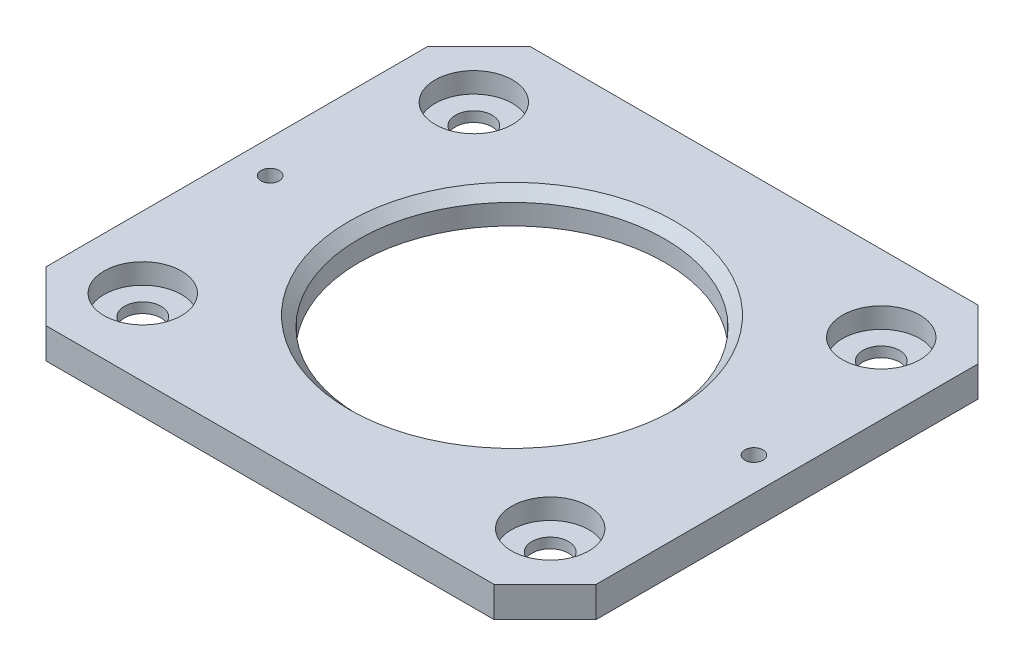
ISO-10303-21;
HEADER;
FILE_DESCRIPTION(('STEP AP214'),'2;1');
FILE_NAME('part.step','',(''),(''),'','','');
FILE_SCHEMA(('AUTOMOTIVE_DESIGN { 1 0 10303 214 1 1 1 1 }'));
ENDSEC;
DATA;
#1=APPLICATION_CONTEXT('core data for automotive mechanical design processes');
#2=APPLICATION_PROTOCOL_DEFINITION('international standard','automotive_design',2000,#1);
#3=PRODUCT_CONTEXT('',#1,'mechanical');
#4=PRODUCT('Part','Part','',(#3));
#5=PRODUCT_RELATED_PRODUCT_CATEGORY('part','',(#4));
#6=PRODUCT_DEFINITION_FORMATION('','',#4);
#7=PRODUCT_DEFINITION_CONTEXT('part definition',#1,'design');
#8=PRODUCT_DEFINITION('design','',#6,#7);
#9=PRODUCT_DEFINITION_SHAPE('','',#8);
#10=(LENGTH_UNIT() NAMED_UNIT(*) SI_UNIT(.MILLI.,.METRE.));
#11=(NAMED_UNIT(*) PLANE_ANGLE_UNIT() SI_UNIT($,.RADIAN.));
#12=(NAMED_UNIT(*) SI_UNIT($,.STERADIAN.) SOLID_ANGLE_UNIT());
#13=UNCERTAINTY_MEASURE_WITH_UNIT(LENGTH_MEASURE(1.E-05),#10,'distance_accuracy_value','');
#14=(GEOMETRIC_REPRESENTATION_CONTEXT(3) GLOBAL_UNCERTAINTY_ASSIGNED_CONTEXT((#13)) GLOBAL_UNIT_ASSIGNED_CONTEXT((#10,
#11,#12)) REPRESENTATION_CONTEXT('',''));
#15=CARTESIAN_POINT('',(0.,0.,0.));
#16=DIRECTION('',(0.,0.,1.));
#17=DIRECTION('',(1.,0.,0.));
#18=AXIS2_PLACEMENT_3D('',#15,#16,#17);
#19=CARTESIAN_POINT('',(0.,0.,0.));
#20=DIRECTION('',(0.,-1.,0.));
#21=DIRECTION('',(0.,0.,-1.));
#22=AXIS2_PLACEMENT_3D('',#19,#20,#21);
#23=PLANE('',#22);
#24=CARTESIAN_POINT('',(0.,0.,0.));
#25=DIRECTION('',(0.,1.,0.));
#26=DIRECTION('',(0.,0.,1.));
#27=AXIS2_PLACEMENT_3D('',#24,#25,#26);
#28=CIRCLE('',#27,19.05);
#29=CARTESIAN_POINT('',(0.,0.,19.05));
#30=VERTEX_POINT('',#29);
#31=EDGE_CURVE('E154',#30,#30,#28,.T.);
#32=ORIENTED_EDGE('',*,*,#31,.T.);
#33=EDGE_LOOP('',(#32));
#34=FACE_BOUND('',#33,.T.);
#35=CARTESIAN_POINT('',(0.,0.,0.));
#36=DIRECTION('',(0.,-1.,0.));
#37=DIRECTION('',(0.,0.,-1.));
#38=AXIS2_PLACEMENT_3D('',#35,#36,#37);
#39=CIRCLE('',#38,22.0853);
#40=CARTESIAN_POINT('',(0.,0.,-22.0853));
#41=VERTEX_POINT('',#40);
#42=EDGE_CURVE('E417',#41,#41,#39,.T.);
#43=ORIENTED_EDGE('',*,*,#42,.T.);
#44=EDGE_LOOP('',(#43));
#45=FACE_BOUND('',#44,.T.);
#46=ADVANCED_FACE('F34',(#34,#45),#23,.T.);
#47=CARTESIAN_POINT('',(0.,3.81,0.));
#48=DIRECTION('',(0.,-1.,0.));
#49=DIRECTION('',(0.,0.,-1.));
#50=AXIS2_PLACEMENT_3D('',#47,#48,#49);
#51=PLANE('',#50);
#52=CARTESIAN_POINT('',(0.,3.81,0.));
#53=DIRECTION('',(0.,-1.,0.));
#54=DIRECTION('',(0.,0.,-1.));
#55=AXIS2_PLACEMENT_3D('',#52,#53,#54);
#56=CIRCLE('',#55,20.3199999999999);
#57=CARTESIAN_POINT('',(0.,3.81,-20.3199999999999));
#58=VERTEX_POINT('',#57);
#59=EDGE_CURVE('E43',#58,#58,#56,.T.);
#60=ORIENTED_EDGE('',*,*,#59,.T.);
#61=EDGE_LOOP('',(#60));
#62=FACE_BOUND('',#61,.T.);
#63=CARTESIAN_POINT('',(-30.1625,3.81,0.));
#64=DIRECTION('',(0.,1.,0.));
#65=DIRECTION('',(0.,0.,1.));
#66=AXIS2_PLACEMENT_3D('',#63,#64,#65);
#67=CIRCLE('',#66,1.13029999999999);
#68=CARTESIAN_POINT('',(-30.1625,3.81,1.13029999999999));
#69=VERTEX_POINT('',#68);
#70=EDGE_CURVE('E117',#69,#69,#67,.T.);
#71=ORIENTED_EDGE('',*,*,#70,.F.);
#72=EDGE_LOOP('',(#71));
#73=FACE_BOUND('',#72,.T.);
#74=CARTESIAN_POINT('',(25.4,3.81,20.6375));
#75=DIRECTION('',(0.,-1.,0.));
#76=DIRECTION('',(0.,0.,-1.));
#77=AXIS2_PLACEMENT_3D('',#74,#75,#76);
#78=CIRCLE('',#77,4.826);
#79=CARTESIAN_POINT('',(25.4,3.81,15.8115));
#80=VERTEX_POINT('',#79);
#81=EDGE_CURVE('E141',#80,#80,#78,.F.);
#82=ORIENTED_EDGE('',*,*,#81,.F.);
#83=EDGE_LOOP('',(#82));
#84=FACE_BOUND('',#83,.T.);
#85=CARTESIAN_POINT('',(25.4,3.81,-20.6375));
#86=DIRECTION('',(0.,-1.,0.));
#87=DIRECTION('',(0.,0.,-1.));
#88=AXIS2_PLACEMENT_3D('',#85,#86,#87);
#89=CIRCLE('',#88,4.826);
#90=CARTESIAN_POINT('',(25.4,3.81,-25.4635));
#91=VERTEX_POINT('',#90);
#92=EDGE_CURVE('E134',#91,#91,#89,.F.);
#93=ORIENTED_EDGE('',*,*,#92,.F.);
#94=EDGE_LOOP('',(#93));
#95=FACE_BOUND('',#94,.T.);
#96=CARTESIAN_POINT('',(-25.4,3.81,-20.6375));
#97=DIRECTION('',(0.,-1.,0.));
#98=DIRECTION('',(0.,0.,-1.));
#99=AXIS2_PLACEMENT_3D('',#96,#97,#98);
#100=CIRCLE('',#99,4.826);
#101=CARTESIAN_POINT('',(-25.4,3.81,-25.4635));
#102=VERTEX_POINT('',#101);
#103=EDGE_CURVE('E133',#102,#102,#100,.F.);
#104=ORIENTED_EDGE('',*,*,#103,.F.);
#105=EDGE_LOOP('',(#104));
#106=FACE_BOUND('',#105,.T.);
#107=CARTESIAN_POINT('',(-25.4,3.81,20.6375));
#108=DIRECTION('',(0.,-1.,0.));
#109=DIRECTION('',(0.,0.,-1.));
#110=AXIS2_PLACEMENT_3D('',#107,#108,#109);
#111=CIRCLE('',#110,4.826);
#112=CARTESIAN_POINT('',(-25.4,3.81,15.8115));
#113=VERTEX_POINT('',#112);
#114=EDGE_CURVE('E150',#113,#113,#111,.F.);
#115=ORIENTED_EDGE('',*,*,#114,.F.);
#116=EDGE_LOOP('',(#115));
#117=FACE_BOUND('',#116,.T.);
#118=DIRECTION('',(0.,0.,-1.));
#119=VECTOR('',#118,1.);
#120=CARTESIAN_POINT('',(34.29,3.81,30.1625));
#121=LINE('',#120,#119);
#122=CARTESIAN_POINT('',(34.29,3.81,23.8125));
#123=VERTEX_POINT('',#122);
#124=CARTESIAN_POINT('',(34.29,3.81,-23.8124999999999));
#125=VERTEX_POINT('',#124);
#126=EDGE_CURVE('E159',#123,#125,#121,.T.);
#127=ORIENTED_EDGE('',*,*,#126,.T.);
#128=DIRECTION('',(0.707106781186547,0.,0.707106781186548));
#129=VECTOR('',#128,1.);
#130=CARTESIAN_POINT('',(27.94,3.81,-30.1625));
#131=LINE('',#130,#129);
#132=CARTESIAN_POINT('',(27.94,3.81,-30.1625));
#133=VERTEX_POINT('',#132);
#134=EDGE_CURVE('E202',#125,#133,#131,.F.);
#135=ORIENTED_EDGE('',*,*,#134,.T.);
#136=DIRECTION('',(-1.,0.,0.));
#137=VECTOR('',#136,1.);
#138=CARTESIAN_POINT('',(-34.29,3.81,-30.1625));
#139=LINE('',#138,#137);
#140=CARTESIAN_POINT('',(-27.94,3.81,-30.1625));
#141=VERTEX_POINT('',#140);
#142=EDGE_CURVE('E162',#133,#141,#139,.T.);
#143=ORIENTED_EDGE('',*,*,#142,.T.);
#144=DIRECTION('',(0.707106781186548,0.,-0.707106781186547));
#145=VECTOR('',#144,1.);
#146=CARTESIAN_POINT('',(-34.29,3.81,-23.8125));
#147=LINE('',#146,#145);
#148=CARTESIAN_POINT('',(-34.29,3.81,-23.8125));
#149=VERTEX_POINT('',#148);
#150=EDGE_CURVE('E197',#141,#149,#147,.F.);
#151=ORIENTED_EDGE('',*,*,#150,.T.);
#152=DIRECTION('',(0.,0.,1.));
#153=VECTOR('',#152,1.);
#154=CARTESIAN_POINT('',(-34.29,3.81,30.1625));
#155=LINE('',#154,#153);
#156=CARTESIAN_POINT('',(-34.29,3.81,23.8125));
#157=VERTEX_POINT('',#156);
#158=EDGE_CURVE('E166',#149,#157,#155,.T.);
#159=ORIENTED_EDGE('',*,*,#158,.T.);
#160=DIRECTION('',(-0.707106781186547,0.,-0.707106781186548));
#161=VECTOR('',#160,1.);
#162=CARTESIAN_POINT('',(-27.94,3.81,30.1625));
#163=LINE('',#162,#161);
#164=CARTESIAN_POINT('',(-27.94,3.81,30.1625));
#165=VERTEX_POINT('',#164);
#166=EDGE_CURVE('E57',#157,#165,#163,.F.);
#167=ORIENTED_EDGE('',*,*,#166,.T.);
#168=DIRECTION('',(1.,0.,0.));
#169=VECTOR('',#168,1.);
#170=CARTESIAN_POINT('',(-34.29,3.81,30.1625));
#171=LINE('',#170,#169);
#172=CARTESIAN_POINT('',(27.9399999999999,3.81,30.1625));
#173=VERTEX_POINT('',#172);
#174=EDGE_CURVE('E168',#165,#173,#171,.T.);
#175=ORIENTED_EDGE('',*,*,#174,.T.);
#176=DIRECTION('',(-0.707106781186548,0.,0.707106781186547));
#177=VECTOR('',#176,1.);
#178=CARTESIAN_POINT('',(34.29,3.81,23.8125));
#179=LINE('',#178,#177);
#180=EDGE_CURVE('E200',#173,#123,#179,.F.);
#181=ORIENTED_EDGE('',*,*,#180,.T.);
#182=EDGE_LOOP('',(#127,#135,#143,#151,#159,#167,#175,#181));
#183=FACE_BOUND('',#182,.T.);
#184=CARTESIAN_POINT('',(30.1625,3.81,0.));
#185=DIRECTION('',(0.,1.,0.));
#186=DIRECTION('',(0.,0.,1.));
#187=AXIS2_PLACEMENT_3D('',#184,#185,#186);
#188=CIRCLE('',#187,1.13029999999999);
#189=CARTESIAN_POINT('',(30.1625,3.81,1.13029999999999));
#190=VERTEX_POINT('',#189);
#191=EDGE_CURVE('E116',#190,#190,#188,.T.);
#192=ORIENTED_EDGE('',*,*,#191,.F.);
#193=EDGE_LOOP('',(#192));
#194=FACE_BOUND('',#193,.T.);
#195=ADVANCED_FACE('F237',(#62,#73,#84,#95,#106,#117,#183,#194),#51,.F.);
#196=CARTESIAN_POINT('',(34.29,3.81,30.1625));
#197=DIRECTION('',(-1.,0.,0.));
#198=DIRECTION('',(0.,0.,1.));
#199=AXIS2_PLACEMENT_3D('',#196,#197,#198);
#200=PLANE('',#199);
#201=DIRECTION('',(0.,0.,-1.));
#202=VECTOR('',#201,1.);
#203=CARTESIAN_POINT('',(34.29,0.,30.1625));
#204=LINE('',#203,#202);
#205=CARTESIAN_POINT('',(34.29,0.,23.8125));
#206=VERTEX_POINT('',#205);
#207=CARTESIAN_POINT('',(34.29,0.,-23.8124999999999));
#208=VERTEX_POINT('',#207);
#209=EDGE_CURVE('E157',#206,#208,#204,.T.);
#210=ORIENTED_EDGE('',*,*,#209,.T.);
#211=DIRECTION('',(0.,1.,0.));
#212=VECTOR('',#211,1.);
#213=CARTESIAN_POINT('',(34.29,3.81,-23.8125));
#214=LINE('',#213,#212);
#215=EDGE_CURVE('E195',#208,#125,#214,.T.);
#216=ORIENTED_EDGE('',*,*,#215,.T.);
#217=ORIENTED_EDGE('',*,*,#126,.F.);
#218=DIRECTION('',(0.,-1.,0.));
#219=VECTOR('',#218,1.);
#220=CARTESIAN_POINT('',(34.29,3.81,23.8125));
#221=LINE('',#220,#219);
#222=EDGE_CURVE('E192',#123,#206,#221,.T.);
#223=ORIENTED_EDGE('',*,*,#222,.T.);
#224=EDGE_LOOP('',(#210,#216,#217,#223));
#225=FACE_BOUND('',#224,.T.);
#226=ADVANCED_FACE('F259',(#225),#200,.F.);
#227=CARTESIAN_POINT('',(-34.29,3.81,-30.1625));
#228=DIRECTION('',(0.,0.,1.));
#229=DIRECTION('',(1.,0.,0.));
#230=AXIS2_PLACEMENT_3D('',#227,#228,#229);
#231=PLANE('',#230);
#232=ORIENTED_EDGE('',*,*,#142,.F.);
#233=DIRECTION('',(0.,-1.,0.));
#234=VECTOR('',#233,1.);
#235=CARTESIAN_POINT('',(27.94,3.81,-30.1625));
#236=LINE('',#235,#234);
#237=CARTESIAN_POINT('',(27.94,0.,-30.1625));
#238=VERTEX_POINT('',#237);
#239=EDGE_CURVE('E181',#133,#238,#236,.T.);
#240=ORIENTED_EDGE('',*,*,#239,.T.);
#241=DIRECTION('',(-1.,0.,0.));
#242=VECTOR('',#241,1.);
#243=CARTESIAN_POINT('',(-34.29,0.,-30.1625));
#244=LINE('',#243,#242);
#245=CARTESIAN_POINT('',(-27.94,0.,-30.1625));
#246=VERTEX_POINT('',#245);
#247=EDGE_CURVE('E173',#238,#246,#244,.T.);
#248=ORIENTED_EDGE('',*,*,#247,.T.);
#249=DIRECTION('',(0.,1.,0.));
#250=VECTOR('',#249,1.);
#251=CARTESIAN_POINT('',(-27.94,3.81,-30.1625));
#252=LINE('',#251,#250);
#253=EDGE_CURVE('E170',#246,#141,#252,.T.);
#254=ORIENTED_EDGE('',*,*,#253,.T.);
#255=EDGE_LOOP('',(#232,#240,#248,#254));
#256=FACE_BOUND('',#255,.T.);
#257=ADVANCED_FACE('F293',(#256),#231,.F.);
#258=CARTESIAN_POINT('',(-34.29,3.81,30.1625));
#259=DIRECTION('',(1.,0.,0.));
#260=DIRECTION('',(0.,0.,-1.));
#261=AXIS2_PLACEMENT_3D('',#258,#259,#260);
#262=PLANE('',#261);
#263=DIRECTION('',(0.,0.,1.));
#264=VECTOR('',#263,1.);
#265=CARTESIAN_POINT('',(-34.29,0.,30.1625));
#266=LINE('',#265,#264);
#267=CARTESIAN_POINT('',(-34.29,0.,-23.8125));
#268=VERTEX_POINT('',#267);
#269=CARTESIAN_POINT('',(-34.29,0.,23.8125));
#270=VERTEX_POINT('',#269);
#271=EDGE_CURVE('E176',#268,#270,#266,.T.);
#272=ORIENTED_EDGE('',*,*,#271,.T.);
#273=DIRECTION('',(0.,1.,0.));
#274=VECTOR('',#273,1.);
#275=CARTESIAN_POINT('',(-34.29,3.81,23.8125));
#276=LINE('',#275,#274);
#277=EDGE_CURVE('E211',#270,#157,#276,.T.);
#278=ORIENTED_EDGE('',*,*,#277,.T.);
#279=ORIENTED_EDGE('',*,*,#158,.F.);
#280=DIRECTION('',(0.,-1.,0.));
#281=VECTOR('',#280,1.);
#282=CARTESIAN_POINT('',(-34.29,3.81,-23.8125));
#283=LINE('',#282,#281);
#284=EDGE_CURVE('E208',#149,#268,#283,.T.);
#285=ORIENTED_EDGE('',*,*,#284,.T.);
#286=EDGE_LOOP('',(#272,#278,#279,#285));
#287=FACE_BOUND('',#286,.T.);
#288=ADVANCED_FACE('F274',(#287),#262,.F.);
#289=CARTESIAN_POINT('',(-34.29,3.81,30.1625));
#290=DIRECTION('',(0.,0.,-1.));
#291=DIRECTION('',(-1.,0.,0.));
#292=AXIS2_PLACEMENT_3D('',#289,#290,#291);
#293=PLANE('',#292);
#294=DIRECTION('',(1.,0.,0.));
#295=VECTOR('',#294,1.);
#296=CARTESIAN_POINT('',(-34.29,0.,30.1625));
#297=LINE('',#296,#295);
#298=CARTESIAN_POINT('',(-27.94,0.,30.1625));
#299=VERTEX_POINT('',#298);
#300=CARTESIAN_POINT('',(27.9399999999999,0.,30.1625));
#301=VERTEX_POINT('',#300);
#302=EDGE_CURVE('E163',#299,#301,#297,.T.);
#303=ORIENTED_EDGE('',*,*,#302,.T.);
#304=DIRECTION('',(0.,1.,0.));
#305=VECTOR('',#304,1.);
#306=CARTESIAN_POINT('',(27.9399999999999,3.81,30.1625));
#307=LINE('',#306,#305);
#308=EDGE_CURVE('E50',#301,#173,#307,.T.);
#309=ORIENTED_EDGE('',*,*,#308,.T.);
#310=ORIENTED_EDGE('',*,*,#174,.F.);
#311=DIRECTION('',(0.,-1.,0.));
#312=VECTOR('',#311,1.);
#313=CARTESIAN_POINT('',(-27.94,3.81,30.1625));
#314=LINE('',#313,#312);
#315=EDGE_CURVE('E204',#165,#299,#314,.T.);
#316=ORIENTED_EDGE('',*,*,#315,.T.);
#317=EDGE_LOOP('',(#303,#309,#310,#316));
#318=FACE_BOUND('',#317,.T.);
#319=ADVANCED_FACE('F265',(#318),#293,.F.);
#320=CARTESIAN_POINT('',(0.,0.,0.));
#321=DIRECTION('',(0.,-1.,0.));
#322=DIRECTION('',(0.,0.,-1.));
#323=AXIS2_PLACEMENT_3D('',#320,#321,#322);
#324=CIRCLE('',#323,23.8633);
#325=CARTESIAN_POINT('',(0.,0.,-23.8633));
#326=VERTEX_POINT('',#325);
#327=EDGE_CURVE('E278',#326,#326,#324,.T.);
#328=ORIENTED_EDGE('',*,*,#327,.F.);
#329=EDGE_LOOP('',(#328));
#330=FACE_BOUND('',#329,.T.);
#331=CARTESIAN_POINT('',(25.4,0.,20.6375));
#332=DIRECTION('',(0.,-1.,0.));
#333=DIRECTION('',(0.,0.,-1.));
#334=AXIS2_PLACEMENT_3D('',#331,#332,#333);
#335=CIRCLE('',#334,2.286);
#336=CARTESIAN_POINT('',(25.4,0.,18.3515));
#337=VERTEX_POINT('',#336);
#338=EDGE_CURVE('E158',#337,#337,#335,.T.);
#339=ORIENTED_EDGE('',*,*,#338,.F.);
#340=EDGE_LOOP('',(#339));
#341=FACE_BOUND('',#340,.T.);
#342=CARTESIAN_POINT('',(25.4,0.,-20.6375));
#343=DIRECTION('',(0.,-1.,0.));
#344=DIRECTION('',(0.,0.,-1.));
#345=AXIS2_PLACEMENT_3D('',#342,#343,#344);
#346=CIRCLE('',#345,2.286);
#347=CARTESIAN_POINT('',(25.4,0.,-22.9235));
#348=VERTEX_POINT('',#347);
#349=EDGE_CURVE('E220',#348,#348,#346,.T.);
#350=ORIENTED_EDGE('',*,*,#349,.F.);
#351=EDGE_LOOP('',(#350));
#352=FACE_BOUND('',#351,.T.);
#353=CARTESIAN_POINT('',(-25.4,0.,-20.6375));
#354=DIRECTION('',(0.,-1.,0.));
#355=DIRECTION('',(0.,0.,-1.));
#356=AXIS2_PLACEMENT_3D('',#353,#354,#355);
#357=CIRCLE('',#356,2.286);
#358=CARTESIAN_POINT('',(-25.4,0.,-22.9235));
#359=VERTEX_POINT('',#358);
#360=EDGE_CURVE('E216',#359,#359,#357,.T.);
#361=ORIENTED_EDGE('',*,*,#360,.F.);
#362=EDGE_LOOP('',(#361));
#363=FACE_BOUND('',#362,.T.);
#364=CARTESIAN_POINT('',(-25.4,0.,20.6375));
#365=DIRECTION('',(0.,-1.,0.));
#366=DIRECTION('',(0.,0.,-1.));
#367=AXIS2_PLACEMENT_3D('',#364,#365,#366);
#368=CIRCLE('',#367,2.286);
#369=CARTESIAN_POINT('',(-25.4,0.,18.3515));
#370=VERTEX_POINT('',#369);
#371=EDGE_CURVE('E213',#370,#370,#368,.T.);
#372=ORIENTED_EDGE('',*,*,#371,.F.);
#373=EDGE_LOOP('',(#372));
#374=FACE_BOUND('',#373,.T.);
#375=ORIENTED_EDGE('',*,*,#247,.F.);
#376=DIRECTION('',(-0.707106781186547,0.,-0.707106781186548));
#377=VECTOR('',#376,1.);
#378=CARTESIAN_POINT('',(29.05125,0.,-29.0512499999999));
#379=LINE('',#378,#377);
#380=EDGE_CURVE('E190',#238,#208,#379,.F.);
#381=ORIENTED_EDGE('',*,*,#380,.T.);
#382=ORIENTED_EDGE('',*,*,#209,.F.);
#383=DIRECTION('',(0.707106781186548,0.,-0.707106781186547));
#384=VECTOR('',#383,1.);
#385=CARTESIAN_POINT('',(29.0512499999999,0.,29.05125));
#386=LINE('',#385,#384);
#387=EDGE_CURVE('E188',#206,#301,#386,.F.);
#388=ORIENTED_EDGE('',*,*,#387,.T.);
#389=ORIENTED_EDGE('',*,*,#302,.F.);
#390=DIRECTION('',(0.707106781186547,0.,0.707106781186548));
#391=VECTOR('',#390,1.);
#392=CARTESIAN_POINT('',(-29.05125,0.,29.05125));
#393=LINE('',#392,#391);
#394=EDGE_CURVE('E186',#299,#270,#393,.F.);
#395=ORIENTED_EDGE('',*,*,#394,.T.);
#396=ORIENTED_EDGE('',*,*,#271,.F.);
#397=DIRECTION('',(-0.707106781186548,0.,0.707106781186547));
#398=VECTOR('',#397,1.);
#399=CARTESIAN_POINT('',(-29.05125,0.,-29.05125));
#400=LINE('',#399,#398);
#401=EDGE_CURVE('E184',#268,#246,#400,.F.);
#402=ORIENTED_EDGE('',*,*,#401,.T.);
#403=EDGE_LOOP('',(#375,#381,#382,#388,#389,#395,#396,#402));
#404=FACE_BOUND('',#403,.T.);
#405=ADVANCED_FACE('F255',(#330,#341,#352,#363,#374,#404),#23,.T.);
#406=CARTESIAN_POINT('',(27.94,3.81,-30.1625));
#407=DIRECTION('',(-0.707106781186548,0.,0.707106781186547));
#408=DIRECTION('',(0.,-1.,0.));
#409=AXIS2_PLACEMENT_3D('',#406,#407,#408);
#410=PLANE('',#409);
#411=ORIENTED_EDGE('',*,*,#134,.F.);
#412=ORIENTED_EDGE('',*,*,#215,.F.);
#413=ORIENTED_EDGE('',*,*,#380,.F.);
#414=ORIENTED_EDGE('',*,*,#239,.F.);
#415=EDGE_LOOP('',(#411,#412,#413,#414));
#416=FACE_BOUND('',#415,.T.);
#417=ADVANCED_FACE('F264',(#416),#410,.F.);
#418=CARTESIAN_POINT('',(34.29,3.81,23.8125));
#419=DIRECTION('',(-0.707106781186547,0.,-0.707106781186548));
#420=DIRECTION('',(0.,-1.,0.));
#421=AXIS2_PLACEMENT_3D('',#418,#419,#420);
#422=PLANE('',#421);
#423=ORIENTED_EDGE('',*,*,#180,.F.);
#424=ORIENTED_EDGE('',*,*,#308,.F.);
#425=ORIENTED_EDGE('',*,*,#387,.F.);
#426=ORIENTED_EDGE('',*,*,#222,.F.);
#427=EDGE_LOOP('',(#423,#424,#425,#426));
#428=FACE_BOUND('',#427,.T.);
#429=ADVANCED_FACE('F271',(#428),#422,.F.);
#430=CARTESIAN_POINT('',(-27.94,3.81,30.1625));
#431=DIRECTION('',(0.707106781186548,0.,-0.707106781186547));
#432=DIRECTION('',(0.,-1.,0.));
#433=AXIS2_PLACEMENT_3D('',#430,#431,#432);
#434=PLANE('',#433);
#435=ORIENTED_EDGE('',*,*,#166,.F.);
#436=ORIENTED_EDGE('',*,*,#277,.F.);
#437=ORIENTED_EDGE('',*,*,#394,.F.);
#438=ORIENTED_EDGE('',*,*,#315,.F.);
#439=EDGE_LOOP('',(#435,#436,#437,#438));
#440=FACE_BOUND('',#439,.T.);
#441=ADVANCED_FACE('F304',(#440),#434,.F.);
#442=CARTESIAN_POINT('',(-34.29,3.81,-23.8125));
#443=DIRECTION('',(0.707106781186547,0.,0.707106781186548));
#444=DIRECTION('',(0.,-1.,0.));
#445=AXIS2_PLACEMENT_3D('',#442,#443,#444);
#446=PLANE('',#445);
#447=ORIENTED_EDGE('',*,*,#150,.F.);
#448=ORIENTED_EDGE('',*,*,#253,.F.);
#449=ORIENTED_EDGE('',*,*,#401,.F.);
#450=ORIENTED_EDGE('',*,*,#284,.F.);
#451=EDGE_LOOP('',(#447,#448,#449,#450));
#452=FACE_BOUND('',#451,.T.);
#453=ADVANCED_FACE('F297',(#452),#446,.F.);
#454=CARTESIAN_POINT('',(0.,0.,0.));
#455=DIRECTION('',(0.,1.,0.));
#456=DIRECTION('',(0.,0.,1.));
#457=AXIS2_PLACEMENT_3D('',#454,#455,#456);
#458=CYLINDRICAL_SURFACE('',#457,19.05);
#459=CARTESIAN_POINT('',(0.,2.54000000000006,0.));
#460=DIRECTION('',(0.,-1.,0.));
#461=DIRECTION('',(0.,0.,-1.));
#462=AXIS2_PLACEMENT_3D('',#459,#460,#461);
#463=CIRCLE('',#462,19.05);
#464=CARTESIAN_POINT('',(0.,2.54000000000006,19.05));
#465=VERTEX_POINT('',#464);
#466=EDGE_CURVE('E11',#465,#465,#463,.F.);
#467=CARTESIAN_POINT('',(0.,2.54000000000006,19.05));
#468=CARTESIAN_POINT('',(0.,2.51354166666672,19.05));
#469=CARTESIAN_POINT('',(0.,2.48708333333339,19.05));
#470=CARTESIAN_POINT('',(0.,2.43416666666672,19.05));
#471=CARTESIAN_POINT('',(0.,2.40770833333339,19.05));
#472=CARTESIAN_POINT('',(0.,2.35479166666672,19.05));
#473=CARTESIAN_POINT('',(0.,2.32833333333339,19.05));
#474=CARTESIAN_POINT('',(0.,2.27541666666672,19.05));
#475=CARTESIAN_POINT('',(0.,2.24895833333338,19.05));
#476=CARTESIAN_POINT('',(0.,2.19604166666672,19.05));
#477=CARTESIAN_POINT('',(0.,2.16958333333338,19.05));
#478=CARTESIAN_POINT('',(0.,2.11666666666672,19.05));
#479=CARTESIAN_POINT('',(0.,2.09020833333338,19.05));
#480=CARTESIAN_POINT('',(0.,2.03729166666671,19.05));
#481=CARTESIAN_POINT('',(0.,2.01083333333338,19.05));
#482=CARTESIAN_POINT('',(0.,1.95791666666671,19.05));
#483=CARTESIAN_POINT('',(0.,1.93145833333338,19.05));
#484=CARTESIAN_POINT('',(0.,1.87854166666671,19.05));
#485=CARTESIAN_POINT('',(0.,1.85208333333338,19.05));
#486=CARTESIAN_POINT('',(0.,1.79916666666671,19.05));
#487=CARTESIAN_POINT('',(0.,1.77270833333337,19.05));
#488=CARTESIAN_POINT('',(0.,1.71979166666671,19.05));
#489=CARTESIAN_POINT('',(0.,1.69333333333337,19.05));
#490=CARTESIAN_POINT('',(0.,1.6404166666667,19.05));
#491=CARTESIAN_POINT('',(0.,1.61395833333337,19.05));
#492=CARTESIAN_POINT('',(0.,1.5610416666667,19.05));
#493=CARTESIAN_POINT('',(0.,1.53458333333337,19.05));
#494=CARTESIAN_POINT('',(0.,1.4816666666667,19.05));
#495=CARTESIAN_POINT('',(0.,1.45520833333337,19.05));
#496=CARTESIAN_POINT('',(0.,1.4022916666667,19.05));
#497=CARTESIAN_POINT('',(0.,1.37583333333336,19.05));
#498=CARTESIAN_POINT('',(0.,1.3229166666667,19.05));
#499=CARTESIAN_POINT('',(0.,1.29645833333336,19.05));
#500=CARTESIAN_POINT('',(0.,1.2435416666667,19.05));
#501=CARTESIAN_POINT('',(0.,1.21708333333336,19.05));
#502=CARTESIAN_POINT('',(0.,1.16416666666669,19.05));
#503=CARTESIAN_POINT('',(0.,1.13770833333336,19.05));
#504=CARTESIAN_POINT('',(0.,1.08479166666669,19.05));
#505=CARTESIAN_POINT('',(0.,1.05833333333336,19.05));
#506=CARTESIAN_POINT('',(0.,1.00541666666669,19.05));
#507=CARTESIAN_POINT('',(0.,0.978958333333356,19.05));
#508=CARTESIAN_POINT('',(0.,0.926041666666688,19.05));
#509=CARTESIAN_POINT('',(0.,0.899583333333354,19.05));
#510=CARTESIAN_POINT('',(0.,0.846666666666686,19.05));
#511=CARTESIAN_POINT('',(0.,0.820208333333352,19.05));
#512=CARTESIAN_POINT('',(0.,0.767291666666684,19.05));
#513=CARTESIAN_POINT('',(0.,0.74083333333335,19.05));
#514=CARTESIAN_POINT('',(0.,0.687916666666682,19.05));
#515=CARTESIAN_POINT('',(0.,0.661458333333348,19.05));
#516=CARTESIAN_POINT('',(0.,0.608541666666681,19.05));
#517=CARTESIAN_POINT('',(0.,0.582083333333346,19.05));
#518=CARTESIAN_POINT('',(0.,0.529166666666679,19.05));
#519=CARTESIAN_POINT('',(0.,0.502708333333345,19.05));
#520=CARTESIAN_POINT('',(0.,0.449791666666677,19.05));
#521=CARTESIAN_POINT('',(0.,0.423333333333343,19.05));
#522=CARTESIAN_POINT('',(0.,0.370416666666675,19.05));
#523=CARTESIAN_POINT('',(0.,0.343958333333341,19.05));
#524=CARTESIAN_POINT('',(0.,0.291041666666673,19.05));
#525=CARTESIAN_POINT('',(0.,0.26458333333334,19.05));
#526=CARTESIAN_POINT('',(0.,0.211666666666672,19.05));
#527=CARTESIAN_POINT('',(0.,0.185208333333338,19.05));
#528=CARTESIAN_POINT('',(0.,0.13229166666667,19.05));
#529=CARTESIAN_POINT('',(0.,0.105833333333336,19.05));
#530=CARTESIAN_POINT('',(0.,0.0529166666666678,19.05));
#531=CARTESIAN_POINT('',(0.,0.0264583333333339,19.05));
#532=CARTESIAN_POINT('',(0.,0.,19.05));
#533=B_SPLINE_CURVE_WITH_KNOTS('',3,(#467,#468,#469,#470,#471,#472,#473,#474,#475,#476,#477,
#478,#479,#480,#481,#482,#483,#484,#485,#486,#487,#488,#489,#490,#491,#492,#493,#494,#495,#496,
#497,#498,#499,#500,#501,#502,#503,#504,#505,#506,#507,#508,#509,#510,#511,#512,#513,#514,#515,
#516,#517,#518,#519,#520,#521,#522,#523,#524,#525,#526,#527,#528,#529,#530,#531,#532),
.UNSPECIFIED.,.F.,.F.,(4,2,2,2,2,2,2,2,2,2,2,2,2,2,2,2,2,2,2,2,2,2,2,2,2,2,2,2,2,2,2,2,4),(0.,
0.0793750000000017,0.158750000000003,0.238125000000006,0.317500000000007,0.396875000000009,
0.476250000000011,0.555625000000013,0.635000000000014,0.714375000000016,0.793750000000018,
0.87312500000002,0.952500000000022,1.03187500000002,1.11125000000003,1.19062500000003,
1.27000000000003,1.34937500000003,1.42875000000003,1.50812500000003,1.58750000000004,
1.66687500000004,1.74625000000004,1.82562500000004,1.90500000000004,1.98437500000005,
2.06375000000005,2.14312500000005,2.22250000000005,2.30187500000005,2.38125000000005,
2.46062500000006,2.54000000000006),.UNSPECIFIED.);
#534=EDGE_CURVE('BSEAM338',#465,#30,#533,.T.);
#535=ORIENTED_EDGE('',*,*,#466,.T.);
#536=ORIENTED_EDGE('',*,*,#31,.F.);
#537=ORIENTED_EDGE('',*,*,#534,.T.);
#538=ORIENTED_EDGE('',*,*,#534,.F.);
#539=EDGE_LOOP('',(#535,#537,#536,#538));
#540=FACE_BOUND('',#539,.T.);
#541=ADVANCED_FACE('F338',(#540),#458,.F.);
#542=CARTESIAN_POINT('',(-25.4,3.81,20.6375));
#543=DIRECTION('',(0.,-1.,0.));
#544=DIRECTION('',(0.,0.,-1.));
#545=AXIS2_PLACEMENT_3D('',#542,#543,#544);
#546=CYLINDRICAL_SURFACE('',#545,2.286);
#547=CARTESIAN_POINT('',(-25.4,1.27,20.6375));
#548=DIRECTION('',(0.,-1.,0.));
#549=DIRECTION('',(0.,0.,-1.));
#550=AXIS2_PLACEMENT_3D('',#547,#548,#549);
#551=CIRCLE('',#550,2.286);
#552=CARTESIAN_POINT('',(-25.4,1.27,18.3515));
#553=VERTEX_POINT('',#552);
#554=EDGE_CURVE('E217',#553,#553,#551,.F.);
#555=CARTESIAN_POINT('',(-25.4,1.27,18.3515));
#556=CARTESIAN_POINT('',(-25.4,1.25677083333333,18.3515));
#557=CARTESIAN_POINT('',(-25.4,1.24354166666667,18.3515));
#558=CARTESIAN_POINT('',(-25.4,1.21708333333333,18.3515));
#559=CARTESIAN_POINT('',(-25.4,1.20385416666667,18.3515));
#560=CARTESIAN_POINT('',(-25.4,1.17739583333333,18.3515));
#561=CARTESIAN_POINT('',(-25.4,1.16416666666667,18.3515));
#562=CARTESIAN_POINT('',(-25.4,1.13770833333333,18.3515));
#563=CARTESIAN_POINT('',(-25.4,1.12447916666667,18.3515));
#564=CARTESIAN_POINT('',(-25.4,1.09802083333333,18.3515));
#565=CARTESIAN_POINT('',(-25.4,1.08479166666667,18.3515));
#566=CARTESIAN_POINT('',(-25.4,1.05833333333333,18.3515));
#567=CARTESIAN_POINT('',(-25.4,1.04510416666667,18.3515));
#568=CARTESIAN_POINT('',(-25.4,1.01864583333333,18.3515));
#569=CARTESIAN_POINT('',(-25.4,1.00541666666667,18.3515));
#570=CARTESIAN_POINT('',(-25.4,0.978958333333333,18.3515));
#571=CARTESIAN_POINT('',(-25.4,0.965729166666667,18.3515));
#572=CARTESIAN_POINT('',(-25.4,0.939270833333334,18.3515));
#573=CARTESIAN_POINT('',(-25.4,0.926041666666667,18.3515));
#574=CARTESIAN_POINT('',(-25.4,0.899583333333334,18.3515));
#575=CARTESIAN_POINT('',(-25.4,0.886354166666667,18.3515));
#576=CARTESIAN_POINT('',(-25.4,0.859895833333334,18.3515));
#577=CARTESIAN_POINT('',(-25.4,0.846666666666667,18.3515));
#578=CARTESIAN_POINT('',(-25.4,0.820208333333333,18.3515));
#579=CARTESIAN_POINT('',(-25.4,0.806979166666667,18.3515));
#580=CARTESIAN_POINT('',(-25.4,0.780520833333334,18.3515));
#581=CARTESIAN_POINT('',(-25.4,0.767291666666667,18.3515));
#582=CARTESIAN_POINT('',(-25.4,0.740833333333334,18.3515));
#583=CARTESIAN_POINT('',(-25.4,0.727604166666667,18.3515));
#584=CARTESIAN_POINT('',(-25.4,0.701145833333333,18.3515));
#585=CARTESIAN_POINT('',(-25.4,0.687916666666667,18.3515));
#586=CARTESIAN_POINT('',(-25.4,0.661458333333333,18.3515));
#587=CARTESIAN_POINT('',(-25.4,0.648229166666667,18.3515));
#588=CARTESIAN_POINT('',(-25.4,0.621770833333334,18.3515));
#589=CARTESIAN_POINT('',(-25.4,0.608541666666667,18.3515));
#590=CARTESIAN_POINT('',(-25.4,0.582083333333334,18.3515));
#591=CARTESIAN_POINT('',(-25.4,0.568854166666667,18.3515));
#592=CARTESIAN_POINT('',(-25.4,0.542395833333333,18.3515));
#593=CARTESIAN_POINT('',(-25.4,0.529166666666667,18.3515));
#594=CARTESIAN_POINT('',(-25.4,0.502708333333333,18.3515));
#595=CARTESIAN_POINT('',(-25.4,0.489479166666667,18.3515));
#596=CARTESIAN_POINT('',(-25.4,0.463020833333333,18.3515));
#597=CARTESIAN_POINT('',(-25.4,0.449791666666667,18.3515));
#598=CARTESIAN_POINT('',(-25.4,0.423333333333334,18.3515));
#599=CARTESIAN_POINT('',(-25.4,0.410104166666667,18.3515));
#600=CARTESIAN_POINT('',(-25.4,0.383645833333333,18.3515));
#601=CARTESIAN_POINT('',(-25.4,0.370416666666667,18.3515));
#602=CARTESIAN_POINT('',(-25.4,0.343958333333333,18.3515));
#603=CARTESIAN_POINT('',(-25.4,0.330729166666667,18.3515));
#604=CARTESIAN_POINT('',(-25.4,0.304270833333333,18.3515));
#605=CARTESIAN_POINT('',(-25.4,0.291041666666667,18.3515));
#606=CARTESIAN_POINT('',(-25.4,0.264583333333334,18.3515));
#607=CARTESIAN_POINT('',(-25.4,0.251354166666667,18.3515));
#608=CARTESIAN_POINT('',(-25.4,0.224895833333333,18.3515));
#609=CARTESIAN_POINT('',(-25.4,0.211666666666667,18.3515));
#610=CARTESIAN_POINT('',(-25.4,0.185208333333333,18.3515));
#611=CARTESIAN_POINT('',(-25.4,0.171979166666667,18.3515));
#612=CARTESIAN_POINT('',(-25.4,0.145520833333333,18.3515));
#613=CARTESIAN_POINT('',(-25.4,0.132291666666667,18.3515));
#614=CARTESIAN_POINT('',(-25.4,0.105833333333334,18.3515));
#615=CARTESIAN_POINT('',(-25.4,0.0926041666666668,18.3515));
#616=CARTESIAN_POINT('',(-25.4,0.0661458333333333,18.3515));
#617=CARTESIAN_POINT('',(-25.4,0.0529166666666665,18.3515));
#618=CARTESIAN_POINT('',(-25.4,0.0264583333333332,18.3515));
#619=CARTESIAN_POINT('',(-25.4,0.0132291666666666,18.3515));
#620=CARTESIAN_POINT('',(-25.4,0.,18.3515));
#621=B_SPLINE_CURVE_WITH_KNOTS('',3,(#555,#556,#557,#558,#559,#560,#561,#562,#563,#564,#565,
#566,#567,#568,#569,#570,#571,#572,#573,#574,#575,#576,#577,#578,#579,#580,#581,#582,#583,#584,
#585,#586,#587,#588,#589,#590,#591,#592,#593,#594,#595,#596,#597,#598,#599,#600,#601,#602,#603,
#604,#605,#606,#607,#608,#609,#610,#611,#612,#613,#614,#615,#616,#617,#618,#619,#620),
.UNSPECIFIED.,.F.,.F.,(4,2,2,2,2,2,2,2,2,2,2,2,2,2,2,2,2,2,2,2,2,2,2,2,2,2,2,2,2,2,2,2,4),(0.,
0.0396874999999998,0.079375,0.1190625,0.15875,0.1984375,0.238125,0.2778125,0.3175,0.3571875,
0.396875,0.4365625,0.47625,0.5159375,0.555625,0.5953125,0.635,0.6746875,0.714375,0.7540625,
0.79375,0.8334375,0.873125,0.9128125,0.9525,0.9921875,1.031875,1.0715625,1.11125,1.1509375,
1.190625,1.2303125,1.27),.UNSPECIFIED.);
#622=EDGE_CURVE('BSEAM342',#553,#370,#621,.T.);
#623=ORIENTED_EDGE('',*,*,#554,.T.);
#624=ORIENTED_EDGE('',*,*,#371,.T.);
#625=ORIENTED_EDGE('',*,*,#622,.T.);
#626=ORIENTED_EDGE('',*,*,#622,.F.);
#627=EDGE_LOOP('',(#623,#625,#624,#626));
#628=FACE_BOUND('',#627,.T.);
#629=ADVANCED_FACE('F342',(#628),#546,.F.);
#630=CARTESIAN_POINT('',(-25.4,3.81,-20.6375));
#631=DIRECTION('',(0.,-1.,0.));
#632=DIRECTION('',(0.,0.,-1.));
#633=AXIS2_PLACEMENT_3D('',#630,#631,#632);
#634=CYLINDRICAL_SURFACE('',#633,2.286);
#635=CARTESIAN_POINT('',(-25.4,1.27,-20.6375));
#636=DIRECTION('',(0.,-1.,0.));
#637=DIRECTION('',(0.,0.,-1.));
#638=AXIS2_PLACEMENT_3D('',#635,#636,#637);
#639=CIRCLE('',#638,2.286);
#640=CARTESIAN_POINT('',(-25.4,1.27,-22.9235));
#641=VERTEX_POINT('',#640);
#642=EDGE_CURVE('E230',#641,#641,#639,.F.);
#643=CARTESIAN_POINT('',(-25.4,1.27,-22.9235));
#644=CARTESIAN_POINT('',(-25.4,1.25677083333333,-22.9235));
#645=CARTESIAN_POINT('',(-25.4,1.24354166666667,-22.9235));
#646=CARTESIAN_POINT('',(-25.4,1.21708333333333,-22.9235));
#647=CARTESIAN_POINT('',(-25.4,1.20385416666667,-22.9235));
#648=CARTESIAN_POINT('',(-25.4,1.17739583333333,-22.9235));
#649=CARTESIAN_POINT('',(-25.4,1.16416666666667,-22.9235));
#650=CARTESIAN_POINT('',(-25.4,1.13770833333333,-22.9235));
#651=CARTESIAN_POINT('',(-25.4,1.12447916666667,-22.9235));
#652=CARTESIAN_POINT('',(-25.4,1.09802083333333,-22.9235));
#653=CARTESIAN_POINT('',(-25.4,1.08479166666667,-22.9235));
#654=CARTESIAN_POINT('',(-25.4,1.05833333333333,-22.9235));
#655=CARTESIAN_POINT('',(-25.4,1.04510416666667,-22.9235));
#656=CARTESIAN_POINT('',(-25.4,1.01864583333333,-22.9235));
#657=CARTESIAN_POINT('',(-25.4,1.00541666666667,-22.9235));
#658=CARTESIAN_POINT('',(-25.4,0.978958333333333,-22.9235));
#659=CARTESIAN_POINT('',(-25.4,0.965729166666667,-22.9235));
#660=CARTESIAN_POINT('',(-25.4,0.939270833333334,-22.9235));
#661=CARTESIAN_POINT('',(-25.4,0.926041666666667,-22.9235));
#662=CARTESIAN_POINT('',(-25.4,0.899583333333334,-22.9235));
#663=CARTESIAN_POINT('',(-25.4,0.886354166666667,-22.9235));
#664=CARTESIAN_POINT('',(-25.4,0.859895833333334,-22.9235));
#665=CARTESIAN_POINT('',(-25.4,0.846666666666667,-22.9235));
#666=CARTESIAN_POINT('',(-25.4,0.820208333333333,-22.9235));
#667=CARTESIAN_POINT('',(-25.4,0.806979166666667,-22.9235));
#668=CARTESIAN_POINT('',(-25.4,0.780520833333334,-22.9235));
#669=CARTESIAN_POINT('',(-25.4,0.767291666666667,-22.9235));
#670=CARTESIAN_POINT('',(-25.4,0.740833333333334,-22.9235));
#671=CARTESIAN_POINT('',(-25.4,0.727604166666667,-22.9235));
#672=CARTESIAN_POINT('',(-25.4,0.701145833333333,-22.9235));
#673=CARTESIAN_POINT('',(-25.4,0.687916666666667,-22.9235));
#674=CARTESIAN_POINT('',(-25.4,0.661458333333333,-22.9235));
#675=CARTESIAN_POINT('',(-25.4,0.648229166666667,-22.9235));
#676=CARTESIAN_POINT('',(-25.4,0.621770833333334,-22.9235));
#677=CARTESIAN_POINT('',(-25.4,0.608541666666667,-22.9235));
#678=CARTESIAN_POINT('',(-25.4,0.582083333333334,-22.9235));
#679=CARTESIAN_POINT('',(-25.4,0.568854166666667,-22.9235));
#680=CARTESIAN_POINT('',(-25.4,0.542395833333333,-22.9235));
#681=CARTESIAN_POINT('',(-25.4,0.529166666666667,-22.9235));
#682=CARTESIAN_POINT('',(-25.4,0.502708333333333,-22.9235));
#683=CARTESIAN_POINT('',(-25.4,0.489479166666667,-22.9235));
#684=CARTESIAN_POINT('',(-25.4,0.463020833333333,-22.9235));
#685=CARTESIAN_POINT('',(-25.4,0.449791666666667,-22.9235));
#686=CARTESIAN_POINT('',(-25.4,0.423333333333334,-22.9235));
#687=CARTESIAN_POINT('',(-25.4,0.410104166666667,-22.9235));
#688=CARTESIAN_POINT('',(-25.4,0.383645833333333,-22.9235));
#689=CARTESIAN_POINT('',(-25.4,0.370416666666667,-22.9235));
#690=CARTESIAN_POINT('',(-25.4,0.343958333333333,-22.9235));
#691=CARTESIAN_POINT('',(-25.4,0.330729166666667,-22.9235));
#692=CARTESIAN_POINT('',(-25.4,0.304270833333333,-22.9235));
#693=CARTESIAN_POINT('',(-25.4,0.291041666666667,-22.9235));
#694=CARTESIAN_POINT('',(-25.4,0.264583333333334,-22.9235));
#695=CARTESIAN_POINT('',(-25.4,0.251354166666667,-22.9235));
#696=CARTESIAN_POINT('',(-25.4,0.224895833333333,-22.9235));
#697=CARTESIAN_POINT('',(-25.4,0.211666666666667,-22.9235));
#698=CARTESIAN_POINT('',(-25.4,0.185208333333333,-22.9235));
#699=CARTESIAN_POINT('',(-25.4,0.171979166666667,-22.9235));
#700=CARTESIAN_POINT('',(-25.4,0.145520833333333,-22.9235));
#701=CARTESIAN_POINT('',(-25.4,0.132291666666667,-22.9235));
#702=CARTESIAN_POINT('',(-25.4,0.105833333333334,-22.9235));
#703=CARTESIAN_POINT('',(-25.4,0.0926041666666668,-22.9235));
#704=CARTESIAN_POINT('',(-25.4,0.0661458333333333,-22.9235));
#705=CARTESIAN_POINT('',(-25.4,0.0529166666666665,-22.9235));
#706=CARTESIAN_POINT('',(-25.4,0.0264583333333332,-22.9235));
#707=CARTESIAN_POINT('',(-25.4,0.0132291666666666,-22.9235));
#708=CARTESIAN_POINT('',(-25.4,0.,-22.9235));
#709=B_SPLINE_CURVE_WITH_KNOTS('',3,(#643,#644,#645,#646,#647,#648,#649,#650,#651,#652,#653,
#654,#655,#656,#657,#658,#659,#660,#661,#662,#663,#664,#665,#666,#667,#668,#669,#670,#671,#672,
#673,#674,#675,#676,#677,#678,#679,#680,#681,#682,#683,#684,#685,#686,#687,#688,#689,#690,#691,
#692,#693,#694,#695,#696,#697,#698,#699,#700,#701,#702,#703,#704,#705,#706,#707,#708),
.UNSPECIFIED.,.F.,.F.,(4,2,2,2,2,2,2,2,2,2,2,2,2,2,2,2,2,2,2,2,2,2,2,2,2,2,2,2,2,2,2,2,4),(0.,
0.0396874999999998,0.079375,0.1190625,0.15875,0.1984375,0.238125,0.2778125,0.3175,0.3571875,
0.396875,0.4365625,0.47625,0.5159375,0.555625,0.5953125,0.635,0.6746875,0.714375,0.7540625,
0.79375,0.8334375,0.873125,0.9128125,0.9525,0.9921875,1.031875,1.0715625,1.11125,1.1509375,
1.190625,1.2303125,1.27),.UNSPECIFIED.);
#710=EDGE_CURVE('BSEAM348',#641,#359,#709,.T.);
#711=ORIENTED_EDGE('',*,*,#642,.T.);
#712=ORIENTED_EDGE('',*,*,#360,.T.);
#713=ORIENTED_EDGE('',*,*,#710,.T.);
#714=ORIENTED_EDGE('',*,*,#710,.F.);
#715=EDGE_LOOP('',(#711,#713,#712,#714));
#716=FACE_BOUND('',#715,.T.);
#717=ADVANCED_FACE('F348',(#716),#634,.F.);
#718=CARTESIAN_POINT('',(25.4,3.81,-20.6375));
#719=DIRECTION('',(0.,-1.,0.));
#720=DIRECTION('',(0.,0.,-1.));
#721=AXIS2_PLACEMENT_3D('',#718,#719,#720);
#722=CYLINDRICAL_SURFACE('',#721,2.286);
#723=CARTESIAN_POINT('',(25.4,1.27,-20.6375));
#724=DIRECTION('',(0.,-1.,0.));
#725=DIRECTION('',(0.,0.,-1.));
#726=AXIS2_PLACEMENT_3D('',#723,#724,#725);
#727=CIRCLE('',#726,2.286);
#728=CARTESIAN_POINT('',(25.4,1.27,-22.9235));
#729=VERTEX_POINT('',#728);
#730=EDGE_CURVE('E227',#729,#729,#727,.F.);
#731=CARTESIAN_POINT('',(25.4,1.27,-22.9235));
#732=CARTESIAN_POINT('',(25.4,1.25677083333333,-22.9235));
#733=CARTESIAN_POINT('',(25.4,1.24354166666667,-22.9235));
#734=CARTESIAN_POINT('',(25.4,1.21708333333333,-22.9235));
#735=CARTESIAN_POINT('',(25.4,1.20385416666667,-22.9235));
#736=CARTESIAN_POINT('',(25.4,1.17739583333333,-22.9235));
#737=CARTESIAN_POINT('',(25.4,1.16416666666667,-22.9235));
#738=CARTESIAN_POINT('',(25.4,1.13770833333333,-22.9235));
#739=CARTESIAN_POINT('',(25.4,1.12447916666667,-22.9235));
#740=CARTESIAN_POINT('',(25.4,1.09802083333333,-22.9235));
#741=CARTESIAN_POINT('',(25.4,1.08479166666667,-22.9235));
#742=CARTESIAN_POINT('',(25.4,1.05833333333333,-22.9235));
#743=CARTESIAN_POINT('',(25.4,1.04510416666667,-22.9235));
#744=CARTESIAN_POINT('',(25.4,1.01864583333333,-22.9235));
#745=CARTESIAN_POINT('',(25.4,1.00541666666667,-22.9235));
#746=CARTESIAN_POINT('',(25.4,0.978958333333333,-22.9235));
#747=CARTESIAN_POINT('',(25.4,0.965729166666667,-22.9235));
#748=CARTESIAN_POINT('',(25.4,0.939270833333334,-22.9235));
#749=CARTESIAN_POINT('',(25.4,0.926041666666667,-22.9235));
#750=CARTESIAN_POINT('',(25.4,0.899583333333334,-22.9235));
#751=CARTESIAN_POINT('',(25.4,0.886354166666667,-22.9235));
#752=CARTESIAN_POINT('',(25.4,0.859895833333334,-22.9235));
#753=CARTESIAN_POINT('',(25.4,0.846666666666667,-22.9235));
#754=CARTESIAN_POINT('',(25.4,0.820208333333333,-22.9235));
#755=CARTESIAN_POINT('',(25.4,0.806979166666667,-22.9235));
#756=CARTESIAN_POINT('',(25.4,0.780520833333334,-22.9235));
#757=CARTESIAN_POINT('',(25.4,0.767291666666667,-22.9235));
#758=CARTESIAN_POINT('',(25.4,0.740833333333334,-22.9235));
#759=CARTESIAN_POINT('',(25.4,0.727604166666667,-22.9235));
#760=CARTESIAN_POINT('',(25.4,0.701145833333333,-22.9235));
#761=CARTESIAN_POINT('',(25.4,0.687916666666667,-22.9235));
#762=CARTESIAN_POINT('',(25.4,0.661458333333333,-22.9235));
#763=CARTESIAN_POINT('',(25.4,0.648229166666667,-22.9235));
#764=CARTESIAN_POINT('',(25.4,0.621770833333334,-22.9235));
#765=CARTESIAN_POINT('',(25.4,0.608541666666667,-22.9235));
#766=CARTESIAN_POINT('',(25.4,0.582083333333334,-22.9235));
#767=CARTESIAN_POINT('',(25.4,0.568854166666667,-22.9235));
#768=CARTESIAN_POINT('',(25.4,0.542395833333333,-22.9235));
#769=CARTESIAN_POINT('',(25.4,0.529166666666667,-22.9235));
#770=CARTESIAN_POINT('',(25.4,0.502708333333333,-22.9235));
#771=CARTESIAN_POINT('',(25.4,0.489479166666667,-22.9235));
#772=CARTESIAN_POINT('',(25.4,0.463020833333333,-22.9235));
#773=CARTESIAN_POINT('',(25.4,0.449791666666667,-22.9235));
#774=CARTESIAN_POINT('',(25.4,0.423333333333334,-22.9235));
#775=CARTESIAN_POINT('',(25.4,0.410104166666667,-22.9235));
#776=CARTESIAN_POINT('',(25.4,0.383645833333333,-22.9235));
#777=CARTESIAN_POINT('',(25.4,0.370416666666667,-22.9235));
#778=CARTESIAN_POINT('',(25.4,0.343958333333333,-22.9235));
#779=CARTESIAN_POINT('',(25.4,0.330729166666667,-22.9235));
#780=CARTESIAN_POINT('',(25.4,0.304270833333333,-22.9235));
#781=CARTESIAN_POINT('',(25.4,0.291041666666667,-22.9235));
#782=CARTESIAN_POINT('',(25.4,0.264583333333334,-22.9235));
#783=CARTESIAN_POINT('',(25.4,0.251354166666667,-22.9235));
#784=CARTESIAN_POINT('',(25.4,0.224895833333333,-22.9235));
#785=CARTESIAN_POINT('',(25.4,0.211666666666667,-22.9235));
#786=CARTESIAN_POINT('',(25.4,0.185208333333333,-22.9235));
#787=CARTESIAN_POINT('',(25.4,0.171979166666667,-22.9235));
#788=CARTESIAN_POINT('',(25.4,0.145520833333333,-22.9235));
#789=CARTESIAN_POINT('',(25.4,0.132291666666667,-22.9235));
#790=CARTESIAN_POINT('',(25.4,0.105833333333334,-22.9235));
#791=CARTESIAN_POINT('',(25.4,0.0926041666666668,-22.9235));
#792=CARTESIAN_POINT('',(25.4,0.0661458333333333,-22.9235));
#793=CARTESIAN_POINT('',(25.4,0.0529166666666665,-22.9235));
#794=CARTESIAN_POINT('',(25.4,0.0264583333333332,-22.9235));
#795=CARTESIAN_POINT('',(25.4,0.0132291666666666,-22.9235));
#796=CARTESIAN_POINT('',(25.4,0.,-22.9235));
#797=B_SPLINE_CURVE_WITH_KNOTS('',3,(#731,#732,#733,#734,#735,#736,#737,#738,#739,#740,#741,
#742,#743,#744,#745,#746,#747,#748,#749,#750,#751,#752,#753,#754,#755,#756,#757,#758,#759,#760,
#761,#762,#763,#764,#765,#766,#767,#768,#769,#770,#771,#772,#773,#774,#775,#776,#777,#778,#779,
#780,#781,#782,#783,#784,#785,#786,#787,#788,#789,#790,#791,#792,#793,#794,#795,#796),
.UNSPECIFIED.,.F.,.F.,(4,2,2,2,2,2,2,2,2,2,2,2,2,2,2,2,2,2,2,2,2,2,2,2,2,2,2,2,2,2,2,2,4),(0.,
0.0396874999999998,0.079375,0.1190625,0.15875,0.1984375,0.238125,0.2778125,0.3175,0.3571875,
0.396875,0.4365625,0.47625,0.5159375,0.555625,0.5953125,0.635,0.6746875,0.714375,0.7540625,
0.79375,0.8334375,0.873125,0.9128125,0.9525,0.9921875,1.031875,1.0715625,1.11125,1.1509375,
1.190625,1.2303125,1.27),.UNSPECIFIED.);
#798=EDGE_CURVE('BSEAM357',#729,#348,#797,.T.);
#799=ORIENTED_EDGE('',*,*,#730,.T.);
#800=ORIENTED_EDGE('',*,*,#349,.T.);
#801=ORIENTED_EDGE('',*,*,#798,.T.);
#802=ORIENTED_EDGE('',*,*,#798,.F.);
#803=EDGE_LOOP('',(#799,#801,#800,#802));
#804=FACE_BOUND('',#803,.T.);
#805=ADVANCED_FACE('F357',(#804),#722,.F.);
#806=CARTESIAN_POINT('',(25.4,3.81,20.6375));
#807=DIRECTION('',(0.,-1.,0.));
#808=DIRECTION('',(0.,0.,-1.));
#809=AXIS2_PLACEMENT_3D('',#806,#807,#808);
#810=CYLINDRICAL_SURFACE('',#809,2.286);
#811=CARTESIAN_POINT('',(25.4,1.27,20.6375));
#812=DIRECTION('',(0.,-1.,0.));
#813=DIRECTION('',(0.,0.,-1.));
#814=AXIS2_PLACEMENT_3D('',#811,#812,#813);
#815=CIRCLE('',#814,2.286);
#816=CARTESIAN_POINT('',(25.4,1.27,18.3515));
#817=VERTEX_POINT('',#816);
#818=EDGE_CURVE('E153',#817,#817,#815,.F.);
#819=CARTESIAN_POINT('',(25.4,1.27,18.3515));
#820=CARTESIAN_POINT('',(25.4,1.25677083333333,18.3515));
#821=CARTESIAN_POINT('',(25.4,1.24354166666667,18.3515));
#822=CARTESIAN_POINT('',(25.4,1.21708333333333,18.3515));
#823=CARTESIAN_POINT('',(25.4,1.20385416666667,18.3515));
#824=CARTESIAN_POINT('',(25.4,1.17739583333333,18.3515));
#825=CARTESIAN_POINT('',(25.4,1.16416666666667,18.3515));
#826=CARTESIAN_POINT('',(25.4,1.13770833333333,18.3515));
#827=CARTESIAN_POINT('',(25.4,1.12447916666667,18.3515));
#828=CARTESIAN_POINT('',(25.4,1.09802083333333,18.3515));
#829=CARTESIAN_POINT('',(25.4,1.08479166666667,18.3515));
#830=CARTESIAN_POINT('',(25.4,1.05833333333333,18.3515));
#831=CARTESIAN_POINT('',(25.4,1.04510416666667,18.3515));
#832=CARTESIAN_POINT('',(25.4,1.01864583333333,18.3515));
#833=CARTESIAN_POINT('',(25.4,1.00541666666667,18.3515));
#834=CARTESIAN_POINT('',(25.4,0.978958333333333,18.3515));
#835=CARTESIAN_POINT('',(25.4,0.965729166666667,18.3515));
#836=CARTESIAN_POINT('',(25.4,0.939270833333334,18.3515));
#837=CARTESIAN_POINT('',(25.4,0.926041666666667,18.3515));
#838=CARTESIAN_POINT('',(25.4,0.899583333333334,18.3515));
#839=CARTESIAN_POINT('',(25.4,0.886354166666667,18.3515));
#840=CARTESIAN_POINT('',(25.4,0.859895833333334,18.3515));
#841=CARTESIAN_POINT('',(25.4,0.846666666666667,18.3515));
#842=CARTESIAN_POINT('',(25.4,0.820208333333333,18.3515));
#843=CARTESIAN_POINT('',(25.4,0.806979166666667,18.3515));
#844=CARTESIAN_POINT('',(25.4,0.780520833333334,18.3515));
#845=CARTESIAN_POINT('',(25.4,0.767291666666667,18.3515));
#846=CARTESIAN_POINT('',(25.4,0.740833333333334,18.3515));
#847=CARTESIAN_POINT('',(25.4,0.727604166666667,18.3515));
#848=CARTESIAN_POINT('',(25.4,0.701145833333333,18.3515));
#849=CARTESIAN_POINT('',(25.4,0.687916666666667,18.3515));
#850=CARTESIAN_POINT('',(25.4,0.661458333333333,18.3515));
#851=CARTESIAN_POINT('',(25.4,0.648229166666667,18.3515));
#852=CARTESIAN_POINT('',(25.4,0.621770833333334,18.3515));
#853=CARTESIAN_POINT('',(25.4,0.608541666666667,18.3515));
#854=CARTESIAN_POINT('',(25.4,0.582083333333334,18.3515));
#855=CARTESIAN_POINT('',(25.4,0.568854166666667,18.3515));
#856=CARTESIAN_POINT('',(25.4,0.542395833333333,18.3515));
#857=CARTESIAN_POINT('',(25.4,0.529166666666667,18.3515));
#858=CARTESIAN_POINT('',(25.4,0.502708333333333,18.3515));
#859=CARTESIAN_POINT('',(25.4,0.489479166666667,18.3515));
#860=CARTESIAN_POINT('',(25.4,0.463020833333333,18.3515));
#861=CARTESIAN_POINT('',(25.4,0.449791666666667,18.3515));
#862=CARTESIAN_POINT('',(25.4,0.423333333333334,18.3515));
#863=CARTESIAN_POINT('',(25.4,0.410104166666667,18.3515));
#864=CARTESIAN_POINT('',(25.4,0.383645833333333,18.3515));
#865=CARTESIAN_POINT('',(25.4,0.370416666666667,18.3515));
#866=CARTESIAN_POINT('',(25.4,0.343958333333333,18.3515));
#867=CARTESIAN_POINT('',(25.4,0.330729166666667,18.3515));
#868=CARTESIAN_POINT('',(25.4,0.304270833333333,18.3515));
#869=CARTESIAN_POINT('',(25.4,0.291041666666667,18.3515));
#870=CARTESIAN_POINT('',(25.4,0.264583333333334,18.3515));
#871=CARTESIAN_POINT('',(25.4,0.251354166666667,18.3515));
#872=CARTESIAN_POINT('',(25.4,0.224895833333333,18.3515));
#873=CARTESIAN_POINT('',(25.4,0.211666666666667,18.3515));
#874=CARTESIAN_POINT('',(25.4,0.185208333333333,18.3515));
#875=CARTESIAN_POINT('',(25.4,0.171979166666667,18.3515));
#876=CARTESIAN_POINT('',(25.4,0.145520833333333,18.3515));
#877=CARTESIAN_POINT('',(25.4,0.132291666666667,18.3515));
#878=CARTESIAN_POINT('',(25.4,0.105833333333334,18.3515));
#879=CARTESIAN_POINT('',(25.4,0.0926041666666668,18.3515));
#880=CARTESIAN_POINT('',(25.4,0.0661458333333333,18.3515));
#881=CARTESIAN_POINT('',(25.4,0.0529166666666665,18.3515));
#882=CARTESIAN_POINT('',(25.4,0.0264583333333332,18.3515));
#883=CARTESIAN_POINT('',(25.4,0.0132291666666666,18.3515));
#884=CARTESIAN_POINT('',(25.4,0.,18.3515));
#885=B_SPLINE_CURVE_WITH_KNOTS('',3,(#819,#820,#821,#822,#823,#824,#825,#826,#827,#828,#829,
#830,#831,#832,#833,#834,#835,#836,#837,#838,#839,#840,#841,#842,#843,#844,#845,#846,#847,#848,
#849,#850,#851,#852,#853,#854,#855,#856,#857,#858,#859,#860,#861,#862,#863,#864,#865,#866,#867,
#868,#869,#870,#871,#872,#873,#874,#875,#876,#877,#878,#879,#880,#881,#882,#883,#884),
.UNSPECIFIED.,.F.,.F.,(4,2,2,2,2,2,2,2,2,2,2,2,2,2,2,2,2,2,2,2,2,2,2,2,2,2,2,2,2,2,2,2,4),(0.,
0.0396874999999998,0.079375,0.1190625,0.15875,0.1984375,0.238125,0.2778125,0.3175,0.3571875,
0.396875,0.4365625,0.47625,0.5159375,0.555625,0.5953125,0.635,0.6746875,0.714375,0.7540625,
0.79375,0.8334375,0.873125,0.9128125,0.9525,0.9921875,1.031875,1.0715625,1.11125,1.1509375,
1.190625,1.2303125,1.27),.UNSPECIFIED.);
#886=EDGE_CURVE('BSEAM353',#817,#337,#885,.T.);
#887=ORIENTED_EDGE('',*,*,#818,.T.);
#888=ORIENTED_EDGE('',*,*,#338,.T.);
#889=ORIENTED_EDGE('',*,*,#886,.T.);
#890=ORIENTED_EDGE('',*,*,#886,.F.);
#891=EDGE_LOOP('',(#887,#889,#888,#890));
#892=FACE_BOUND('',#891,.T.);
#893=ADVANCED_FACE('F353',(#892),#810,.F.);
#894=CARTESIAN_POINT('',(25.4,1.27,20.6375));
#895=DIRECTION('',(0.,-1.,0.));
#896=DIRECTION('',(0.,0.,-1.));
#897=AXIS2_PLACEMENT_3D('',#894,#895,#896);
#898=PLANE('',#897);
#899=CARTESIAN_POINT('',(25.4,1.27,20.6375));
#900=DIRECTION('',(0.,-1.,0.));
#901=DIRECTION('',(0.,0.,-1.));
#902=AXIS2_PLACEMENT_3D('',#899,#900,#901);
#903=CIRCLE('',#902,4.826);
#904=CARTESIAN_POINT('',(25.4,1.27,15.8115));
#905=VERTEX_POINT('',#904);
#906=EDGE_CURVE('E129',#905,#905,#903,.T.);
#907=ORIENTED_EDGE('',*,*,#906,.F.);
#908=EDGE_LOOP('',(#907));
#909=FACE_BOUND('',#908,.T.);
#910=ORIENTED_EDGE('',*,*,#818,.F.);
#911=EDGE_LOOP('',(#910));
#912=FACE_BOUND('',#911,.T.);
#913=ADVANCED_FACE('F356',(#909,#912),#898,.F.);
#914=CARTESIAN_POINT('',(25.4,17.4599893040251,20.6375));
#915=DIRECTION('',(0.,-1.,0.));
#916=DIRECTION('',(0.,0.,-1.));
#917=AXIS2_PLACEMENT_3D('',#914,#915,#916);
#918=CYLINDRICAL_SURFACE('',#917,4.826);
#919=ORIENTED_EDGE('',*,*,#81,.T.);
#920=EDGE_LOOP('',(#919));
#921=FACE_BOUND('',#920,.T.);
#922=ORIENTED_EDGE('',*,*,#906,.T.);
#923=EDGE_LOOP('',(#922));
#924=FACE_BOUND('',#923,.T.);
#925=ADVANCED_FACE('F375',(#921,#924),#918,.F.);
#926=CARTESIAN_POINT('',(25.4,1.27,-20.6375));
#927=DIRECTION('',(0.,-1.,0.));
#928=DIRECTION('',(0.,0.,-1.));
#929=AXIS2_PLACEMENT_3D('',#926,#927,#928);
#930=PLANE('',#929);
#931=CARTESIAN_POINT('',(25.4,1.27,-20.6375));
#932=DIRECTION('',(0.,-1.,0.));
#933=DIRECTION('',(0.,0.,-1.));
#934=AXIS2_PLACEMENT_3D('',#931,#932,#933);
#935=CIRCLE('',#934,4.826);
#936=CARTESIAN_POINT('',(25.4,1.27,-25.4635));
#937=VERTEX_POINT('',#936);
#938=EDGE_CURVE('E138',#937,#937,#935,.T.);
#939=ORIENTED_EDGE('',*,*,#938,.F.);
#940=EDGE_LOOP('',(#939));
#941=FACE_BOUND('',#940,.T.);
#942=ORIENTED_EDGE('',*,*,#730,.F.);
#943=EDGE_LOOP('',(#942));
#944=FACE_BOUND('',#943,.T.);
#945=ADVANCED_FACE('F378',(#941,#944),#930,.F.);
#946=CARTESIAN_POINT('',(25.4,17.4599893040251,-20.6375));
#947=DIRECTION('',(0.,-1.,0.));
#948=DIRECTION('',(0.,0.,-1.));
#949=AXIS2_PLACEMENT_3D('',#946,#947,#948);
#950=CYLINDRICAL_SURFACE('',#949,4.826);
#951=ORIENTED_EDGE('',*,*,#92,.T.);
#952=EDGE_LOOP('',(#951));
#953=FACE_BOUND('',#952,.T.);
#954=ORIENTED_EDGE('',*,*,#938,.T.);
#955=EDGE_LOOP('',(#954));
#956=FACE_BOUND('',#955,.T.);
#957=ADVANCED_FACE('F383',(#953,#956),#950,.F.);
#958=CARTESIAN_POINT('',(-25.4,1.27,-20.6375));
#959=DIRECTION('',(0.,-1.,0.));
#960=DIRECTION('',(0.,0.,-1.));
#961=AXIS2_PLACEMENT_3D('',#958,#959,#960);
#962=PLANE('',#961);
#963=CARTESIAN_POINT('',(-25.4,1.27,-20.6375));
#964=DIRECTION('',(0.,-1.,0.));
#965=DIRECTION('',(0.,0.,-1.));
#966=AXIS2_PLACEMENT_3D('',#963,#964,#965);
#967=CIRCLE('',#966,4.826);
#968=CARTESIAN_POINT('',(-25.4,1.27,-25.4635));
#969=VERTEX_POINT('',#968);
#970=EDGE_CURVE('E130',#969,#969,#967,.T.);
#971=ORIENTED_EDGE('',*,*,#970,.F.);
#972=EDGE_LOOP('',(#971));
#973=FACE_BOUND('',#972,.T.);
#974=ORIENTED_EDGE('',*,*,#642,.F.);
#975=EDGE_LOOP('',(#974));
#976=FACE_BOUND('',#975,.T.);
#977=ADVANCED_FACE('F386',(#973,#976),#962,.F.);
#978=CARTESIAN_POINT('',(-25.4,17.4599893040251,-20.6375));
#979=DIRECTION('',(0.,-1.,0.));
#980=DIRECTION('',(0.,0.,-1.));
#981=AXIS2_PLACEMENT_3D('',#978,#979,#980);
#982=CYLINDRICAL_SURFACE('',#981,4.826);
#983=ORIENTED_EDGE('',*,*,#103,.T.);
#984=EDGE_LOOP('',(#983));
#985=FACE_BOUND('',#984,.T.);
#986=ORIENTED_EDGE('',*,*,#970,.T.);
#987=EDGE_LOOP('',(#986));
#988=FACE_BOUND('',#987,.T.);
#989=ADVANCED_FACE('F373',(#985,#988),#982,.F.);
#990=CARTESIAN_POINT('',(-25.4,1.27,20.6375));
#991=DIRECTION('',(0.,-1.,0.));
#992=DIRECTION('',(0.,0.,-1.));
#993=AXIS2_PLACEMENT_3D('',#990,#991,#992);
#994=PLANE('',#993);
#995=CARTESIAN_POINT('',(-25.4,1.27,20.6375));
#996=DIRECTION('',(0.,-1.,0.));
#997=DIRECTION('',(0.,0.,-1.));
#998=AXIS2_PLACEMENT_3D('',#995,#996,#997);
#999=CIRCLE('',#998,4.826);
#1000=CARTESIAN_POINT('',(-25.4,1.27,15.8115));
#1001=VERTEX_POINT('',#1000);
#1002=EDGE_CURVE('E137',#1001,#1001,#999,.T.);
#1003=ORIENTED_EDGE('',*,*,#1002,.F.);
#1004=EDGE_LOOP('',(#1003));
#1005=FACE_BOUND('',#1004,.T.);
#1006=ORIENTED_EDGE('',*,*,#554,.F.);
#1007=EDGE_LOOP('',(#1006));
#1008=FACE_BOUND('',#1007,.T.);
#1009=ADVANCED_FACE('F369',(#1005,#1008),#994,.F.);
#1010=CARTESIAN_POINT('',(-25.4,17.4599893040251,20.6375));
#1011=DIRECTION('',(0.,-1.,0.));
#1012=DIRECTION('',(0.,0.,-1.));
#1013=AXIS2_PLACEMENT_3D('',#1010,#1011,#1012);
#1014=CYLINDRICAL_SURFACE('',#1013,4.826);
#1015=ORIENTED_EDGE('',*,*,#114,.T.);
#1016=EDGE_LOOP('',(#1015));
#1017=FACE_BOUND('',#1016,.T.);
#1018=ORIENTED_EDGE('',*,*,#1002,.T.);
#1019=EDGE_LOOP('',(#1018));
#1020=FACE_BOUND('',#1019,.T.);
#1021=ADVANCED_FACE('F365',(#1017,#1020),#1014,.F.);
#1022=CARTESIAN_POINT('',(30.1625,1.94915275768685,0.));
#1023=DIRECTION('',(0.,1.,0.));
#1024=DIRECTION('',(0.,0.,1.));
#1025=AXIS2_PLACEMENT_3D('',#1022,#1023,#1024);
#1026=CONICAL_SURFACE('',#1025,1.1303,1.02974425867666);
#1027=CARTESIAN_POINT('',(30.1625,1.27,0.));
#1028=VERTEX_POINT('',#1027);
#1029=VERTEX_LOOP('',#1028);
#1030=FACE_BOUND('',#1029,.T.);
#1031=CARTESIAN_POINT('',(30.1625,1.94915275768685,0.));
#1032=DIRECTION('',(0.,1.,0.));
#1033=DIRECTION('',(0.,0.,1.));
#1034=AXIS2_PLACEMENT_3D('',#1031,#1032,#1033);
#1035=CIRCLE('',#1034,1.1303);
#1036=CARTESIAN_POINT('',(30.1625,1.94915275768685,1.1303));
#1037=VERTEX_POINT('',#1036);
#1038=EDGE_CURVE('E120',#1037,#1037,#1035,.T.);
#1039=ORIENTED_EDGE('',*,*,#1038,.T.);
#1040=EDGE_LOOP('',(#1039));
#1041=FACE_BOUND('',#1040,.T.);
#1042=ADVANCED_FACE('F368',(#1030,#1041),#1026,.F.);
#1043=CARTESIAN_POINT('',(30.1625,3.81,0.));
#1044=DIRECTION('',(0.,1.,0.));
#1045=DIRECTION('',(0.,0.,1.));
#1046=AXIS2_PLACEMENT_3D('',#1043,#1044,#1045);
#1047=CYLINDRICAL_SURFACE('',#1046,1.13029999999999);
#1048=ORIENTED_EDGE('',*,*,#1038,.F.);
#1049=EDGE_LOOP('',(#1048));
#1050=FACE_BOUND('',#1049,.T.);
#1051=ORIENTED_EDGE('',*,*,#191,.T.);
#1052=EDGE_LOOP('',(#1051));
#1053=FACE_BOUND('',#1052,.T.);
#1054=ADVANCED_FACE('F110',(#1050,#1053),#1047,.F.);
#1055=CARTESIAN_POINT('',(-30.1625,1.94915275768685,0.));
#1056=DIRECTION('',(0.,1.,0.));
#1057=DIRECTION('',(0.,0.,1.));
#1058=AXIS2_PLACEMENT_3D('',#1055,#1056,#1057);
#1059=CONICAL_SURFACE('',#1058,1.1303,1.02974425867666);
#1060=CARTESIAN_POINT('',(-30.1625,1.27,0.));
#1061=VERTEX_POINT('',#1060);
#1062=VERTEX_LOOP('',#1061);
#1063=FACE_BOUND('',#1062,.T.);
#1064=CARTESIAN_POINT('',(-30.1625,1.94915275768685,0.));
#1065=DIRECTION('',(0.,1.,0.));
#1066=DIRECTION('',(0.,0.,1.));
#1067=AXIS2_PLACEMENT_3D('',#1064,#1065,#1066);
#1068=CIRCLE('',#1067,1.1303);
#1069=CARTESIAN_POINT('',(-30.1625,1.94915275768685,1.1303));
#1070=VERTEX_POINT('',#1069);
#1071=EDGE_CURVE('E114',#1070,#1070,#1068,.T.);
#1072=ORIENTED_EDGE('',*,*,#1071,.T.);
#1073=EDGE_LOOP('',(#1072));
#1074=FACE_BOUND('',#1073,.T.);
#1075=ADVANCED_FACE('F106',(#1063,#1074),#1059,.F.);
#1076=CARTESIAN_POINT('',(-30.1625,3.81,0.));
#1077=DIRECTION('',(0.,1.,0.));
#1078=DIRECTION('',(0.,0.,1.));
#1079=AXIS2_PLACEMENT_3D('',#1076,#1077,#1078);
#1080=CYLINDRICAL_SURFACE('',#1079,1.1303);
#1081=ORIENTED_EDGE('',*,*,#1071,.F.);
#1082=EDGE_LOOP('',(#1081));
#1083=FACE_BOUND('',#1082,.T.);
#1084=ORIENTED_EDGE('',*,*,#70,.T.);
#1085=EDGE_LOOP('',(#1084));
#1086=FACE_BOUND('',#1085,.T.);
#1087=ADVANCED_FACE('F109',(#1083,#1086),#1080,.F.);
#1088=CARTESIAN_POINT('',(0.,3.81,0.));
#1089=DIRECTION('',(0.,1.,0.));
#1090=DIRECTION('',(0.,0.,1.));
#1091=AXIS2_PLACEMENT_3D('',#1088,#1089,#1090);
#1092=CONICAL_SURFACE('',#1091,20.3199999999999,0.785398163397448);
#1093=ORIENTED_EDGE('',*,*,#466,.F.);
#1094=EDGE_LOOP('',(#1093));
#1095=FACE_BOUND('',#1094,.T.);
#1096=ORIENTED_EDGE('',*,*,#59,.F.);
#1097=EDGE_LOOP('',(#1096));
#1098=FACE_BOUND('',#1097,.T.);
#1099=ADVANCED_FACE('F37',(#1095,#1098),#1092,.F.);
#1100=CARTESIAN_POINT('',(0.,1.190625,0.));
#1101=DIRECTION('',(0.,-1.,0.));
#1102=DIRECTION('',(0.,0.,-1.));
#1103=AXIS2_PLACEMENT_3D('',#1100,#1101,#1102);
#1104=CYLINDRICAL_SURFACE('',#1103,23.8633);
#1105=CARTESIAN_POINT('',(0.,1.190625,0.));
#1106=DIRECTION('',(0.,-1.,0.));
#1107=DIRECTION('',(0.,0.,-1.));
#1108=AXIS2_PLACEMENT_3D('',#1105,#1106,#1107);
#1109=CIRCLE('',#1108,23.8633);
#1110=CARTESIAN_POINT('',(0.,1.190625,-23.8633));
#1111=VERTEX_POINT('',#1110);
#1112=EDGE_CURVE('E123',#1111,#1111,#1109,.T.);
#1113=CARTESIAN_POINT('',(0.,1.190625,-23.8633));
#1114=CARTESIAN_POINT('',(0.,1.17822265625,-23.8633));
#1115=CARTESIAN_POINT('',(0.,1.1658203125,-23.8633));
#1116=CARTESIAN_POINT('',(0.,1.141015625,-23.8633));
#1117=CARTESIAN_POINT('',(0.,1.12861328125,-23.8633));
#1118=CARTESIAN_POINT('',(0.,1.10380859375,-23.8633));
#1119=CARTESIAN_POINT('',(0.,1.09140625,-23.8633));
#1120=CARTESIAN_POINT('',(0.,1.0666015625,-23.8633));
#1121=CARTESIAN_POINT('',(0.,1.05419921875,-23.8633));
#1122=CARTESIAN_POINT('',(0.,1.02939453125,-23.8633));
#1123=CARTESIAN_POINT('',(0.,1.0169921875,-23.8633));
#1124=CARTESIAN_POINT('',(0.,0.9921875,-23.8633));
#1125=CARTESIAN_POINT('',(0.,0.97978515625,-23.8633));
#1126=CARTESIAN_POINT('',(0.,0.95498046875,-23.8633));
#1127=CARTESIAN_POINT('',(0.,0.942578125,-23.8633));
#1128=CARTESIAN_POINT('',(0.,0.9177734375,-23.8633));
#1129=CARTESIAN_POINT('',(0.,0.90537109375,-23.8633));
#1130=CARTESIAN_POINT('',(0.,0.88056640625,-23.8633));
#1131=CARTESIAN_POINT('',(0.,0.8681640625,-23.8633));
#1132=CARTESIAN_POINT('',(0.,0.843359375,-23.8633));
#1133=CARTESIAN_POINT('',(0.,0.83095703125,-23.8633));
#1134=CARTESIAN_POINT('',(0.,0.80615234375,-23.8633));
#1135=CARTESIAN_POINT('',(0.,0.79375,-23.8633));
#1136=CARTESIAN_POINT('',(0.,0.7689453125,-23.8633));
#1137=CARTESIAN_POINT('',(0.,0.75654296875,-23.8633));
#1138=CARTESIAN_POINT('',(0.,0.73173828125,-23.8633));
#1139=CARTESIAN_POINT('',(0.,0.7193359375,-23.8633));
#1140=CARTESIAN_POINT('',(0.,0.69453125,-23.8633));
#1141=CARTESIAN_POINT('',(0.,0.68212890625,-23.8633));
#1142=CARTESIAN_POINT('',(0.,0.65732421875,-23.8633));
#1143=CARTESIAN_POINT('',(0.,0.644921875,-23.8633));
#1144=CARTESIAN_POINT('',(0.,0.6201171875,-23.8633));
#1145=CARTESIAN_POINT('',(0.,0.60771484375,-23.8633));
#1146=CARTESIAN_POINT('',(0.,0.58291015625,-23.8633));
#1147=CARTESIAN_POINT('',(0.,0.5705078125,-23.8633));
#1148=CARTESIAN_POINT('',(0.,0.545703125,-23.8633));
#1149=CARTESIAN_POINT('',(0.,0.53330078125,-23.8633));
#1150=CARTESIAN_POINT('',(0.,0.50849609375,-23.8633));
#1151=CARTESIAN_POINT('',(0.,0.49609375,-23.8633));
#1152=CARTESIAN_POINT('',(0.,0.4712890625,-23.8633));
#1153=CARTESIAN_POINT('',(0.,0.45888671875,-23.8633));
#1154=CARTESIAN_POINT('',(0.,0.43408203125,-23.8633));
#1155=CARTESIAN_POINT('',(0.,0.4216796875,-23.8633));
#1156=CARTESIAN_POINT('',(0.,0.396875,-23.8633));
#1157=CARTESIAN_POINT('',(0.,0.38447265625,-23.8633));
#1158=CARTESIAN_POINT('',(0.,0.35966796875,-23.8633));
#1159=CARTESIAN_POINT('',(0.,0.347265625,-23.8633));
#1160=CARTESIAN_POINT('',(0.,0.3224609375,-23.8633));
#1161=CARTESIAN_POINT('',(0.,0.31005859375,-23.8633));
#1162=CARTESIAN_POINT('',(0.,0.28525390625,-23.8633));
#1163=CARTESIAN_POINT('',(0.,0.2728515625,-23.8633));
#1164=CARTESIAN_POINT('',(0.,0.248046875,-23.8633));
#1165=CARTESIAN_POINT('',(0.,0.23564453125,-23.8633));
#1166=CARTESIAN_POINT('',(0.,0.21083984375,-23.8633));
#1167=CARTESIAN_POINT('',(0.,0.1984375,-23.8633));
#1168=CARTESIAN_POINT('',(0.,0.1736328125,-23.8633));
#1169=CARTESIAN_POINT('',(0.,0.16123046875,-23.8633));
#1170=CARTESIAN_POINT('',(0.,0.13642578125,-23.8633));
#1171=CARTESIAN_POINT('',(0.,0.1240234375,-23.8633));
#1172=CARTESIAN_POINT('',(0.,0.0992187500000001,-23.8633));
#1173=CARTESIAN_POINT('',(0.,0.08681640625,-23.8633));
#1174=CARTESIAN_POINT('',(0.,0.06201171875,-23.8633));
#1175=CARTESIAN_POINT('',(0.,0.049609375,-23.8633));
#1176=CARTESIAN_POINT('',(0.,0.0248046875,-23.8633));
#1177=CARTESIAN_POINT('',(0.,0.01240234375,-23.8633));
#1178=CARTESIAN_POINT('',(0.,0.,-23.8633));
#1179=B_SPLINE_CURVE_WITH_KNOTS('',3,(#1113,#1114,#1115,#1116,#1117,#1118,#1119,#1120,#1121,
#1122,#1123,#1124,#1125,#1126,#1127,#1128,#1129,#1130,#1131,#1132,#1133,#1134,#1135,#1136,#1137,
#1138,#1139,#1140,#1141,#1142,#1143,#1144,#1145,#1146,#1147,#1148,#1149,#1150,#1151,#1152,#1153,
#1154,#1155,#1156,#1157,#1158,#1159,#1160,#1161,#1162,#1163,#1164,#1165,#1166,#1167,#1168,#1169,
#1170,#1171,#1172,#1173,#1174,#1175,#1176,#1177,#1178),.UNSPECIFIED.,.F.,.F.,(4,2,2,2,2,2,2,2,2,
2,2,2,2,2,2,2,2,2,2,2,2,2,2,2,2,2,2,2,2,2,2,2,4),(0.,0.0372070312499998,0.0744140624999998,
0.11162109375,0.148828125,0.18603515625,0.2232421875,0.26044921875,0.29765625,0.33486328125,
0.3720703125,0.40927734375,0.446484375,0.48369140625,0.5208984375,0.55810546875,0.5953125,
0.63251953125,0.6697265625,0.70693359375,0.744140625,0.78134765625,0.8185546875,0.85576171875,
0.89296875,0.93017578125,0.9673828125,1.00458984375,1.041796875,1.07900390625,1.1162109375,
1.15341796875,1.190625),.UNSPECIFIED.);
#1180=EDGE_CURVE('BSEAM241',#1111,#326,#1179,.T.);
#1181=ORIENTED_EDGE('',*,*,#1112,.F.);
#1182=ORIENTED_EDGE('',*,*,#327,.T.);
#1183=ORIENTED_EDGE('',*,*,#1180,.T.);
#1184=ORIENTED_EDGE('',*,*,#1180,.F.);
#1185=EDGE_LOOP('',(#1181,#1183,#1182,#1184));
#1186=FACE_BOUND('',#1185,.T.);
#1187=ADVANCED_FACE('F241',(#1186),#1104,.F.);
#1188=CARTESIAN_POINT('',(0.,1.190625,0.));
#1189=DIRECTION('',(0.,-1.,0.));
#1190=DIRECTION('',(0.,0.,-1.));
#1191=AXIS2_PLACEMENT_3D('',#1188,#1189,#1190);
#1192=PLANE('',#1191);
#1193=CARTESIAN_POINT('',(0.,1.190625,0.));
#1194=DIRECTION('',(0.,-1.,0.));
#1195=DIRECTION('',(0.,0.,-1.));
#1196=AXIS2_PLACEMENT_3D('',#1193,#1194,#1195);
#1197=CIRCLE('',#1196,22.0853);
#1198=CARTESIAN_POINT('',(0.,1.190625,-22.0853));
#1199=VERTEX_POINT('',#1198);
#1200=EDGE_CURVE('E414',#1199,#1199,#1197,.T.);
#1201=ORIENTED_EDGE('',*,*,#1200,.F.);
#1202=EDGE_LOOP('',(#1201));
#1203=FACE_BOUND('',#1202,.T.);
#1204=ORIENTED_EDGE('',*,*,#1112,.T.);
#1205=EDGE_LOOP('',(#1204));
#1206=FACE_BOUND('',#1205,.T.);
#1207=ADVANCED_FACE('F247',(#1203,#1206),#1192,.T.);
#1208=CARTESIAN_POINT('',(0.,1.190625,0.));
#1209=DIRECTION('',(0.,-1.,0.));
#1210=DIRECTION('',(0.,0.,-1.));
#1211=AXIS2_PLACEMENT_3D('',#1208,#1209,#1210);
#1212=CYLINDRICAL_SURFACE('',#1211,22.0853);
#1213=CARTESIAN_POINT('',(0.,1.190625,-22.0853));
#1214=CARTESIAN_POINT('',(0.,1.17822265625,-22.0853));
#1215=CARTESIAN_POINT('',(0.,1.1658203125,-22.0853));
#1216=CARTESIAN_POINT('',(0.,1.141015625,-22.0853));
#1217=CARTESIAN_POINT('',(0.,1.12861328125,-22.0853));
#1218=CARTESIAN_POINT('',(0.,1.10380859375,-22.0853));
#1219=CARTESIAN_POINT('',(0.,1.09140625,-22.0853));
#1220=CARTESIAN_POINT('',(0.,1.0666015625,-22.0853));
#1221=CARTESIAN_POINT('',(0.,1.05419921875,-22.0853));
#1222=CARTESIAN_POINT('',(0.,1.02939453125,-22.0853));
#1223=CARTESIAN_POINT('',(0.,1.0169921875,-22.0853));
#1224=CARTESIAN_POINT('',(0.,0.9921875,-22.0853));
#1225=CARTESIAN_POINT('',(0.,0.97978515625,-22.0853));
#1226=CARTESIAN_POINT('',(0.,0.95498046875,-22.0853));
#1227=CARTESIAN_POINT('',(0.,0.942578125,-22.0853));
#1228=CARTESIAN_POINT('',(0.,0.9177734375,-22.0853));
#1229=CARTESIAN_POINT('',(0.,0.90537109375,-22.0853));
#1230=CARTESIAN_POINT('',(0.,0.88056640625,-22.0853));
#1231=CARTESIAN_POINT('',(0.,0.8681640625,-22.0853));
#1232=CARTESIAN_POINT('',(0.,0.843359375,-22.0853));
#1233=CARTESIAN_POINT('',(0.,0.83095703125,-22.0853));
#1234=CARTESIAN_POINT('',(0.,0.80615234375,-22.0853));
#1235=CARTESIAN_POINT('',(0.,0.79375,-22.0853));
#1236=CARTESIAN_POINT('',(0.,0.7689453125,-22.0853));
#1237=CARTESIAN_POINT('',(0.,0.75654296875,-22.0853));
#1238=CARTESIAN_POINT('',(0.,0.73173828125,-22.0853));
#1239=CARTESIAN_POINT('',(0.,0.7193359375,-22.0853));
#1240=CARTESIAN_POINT('',(0.,0.69453125,-22.0853));
#1241=CARTESIAN_POINT('',(0.,0.68212890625,-22.0853));
#1242=CARTESIAN_POINT('',(0.,0.65732421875,-22.0853));
#1243=CARTESIAN_POINT('',(0.,0.644921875,-22.0853));
#1244=CARTESIAN_POINT('',(0.,0.6201171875,-22.0853));
#1245=CARTESIAN_POINT('',(0.,0.60771484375,-22.0853));
#1246=CARTESIAN_POINT('',(0.,0.58291015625,-22.0853));
#1247=CARTESIAN_POINT('',(0.,0.5705078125,-22.0853));
#1248=CARTESIAN_POINT('',(0.,0.545703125,-22.0853));
#1249=CARTESIAN_POINT('',(0.,0.53330078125,-22.0853));
#1250=CARTESIAN_POINT('',(0.,0.50849609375,-22.0853));
#1251=CARTESIAN_POINT('',(0.,0.49609375,-22.0853));
#1252=CARTESIAN_POINT('',(0.,0.4712890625,-22.0853));
#1253=CARTESIAN_POINT('',(0.,0.45888671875,-22.0853));
#1254=CARTESIAN_POINT('',(0.,0.43408203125,-22.0853));
#1255=CARTESIAN_POINT('',(0.,0.4216796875,-22.0853));
#1256=CARTESIAN_POINT('',(0.,0.396875,-22.0853));
#1257=CARTESIAN_POINT('',(0.,0.38447265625,-22.0853));
#1258=CARTESIAN_POINT('',(0.,0.35966796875,-22.0853));
#1259=CARTESIAN_POINT('',(0.,0.347265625,-22.0853));
#1260=CARTESIAN_POINT('',(0.,0.3224609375,-22.0853));
#1261=CARTESIAN_POINT('',(0.,0.31005859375,-22.0853));
#1262=CARTESIAN_POINT('',(0.,0.28525390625,-22.0853));
#1263=CARTESIAN_POINT('',(0.,0.2728515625,-22.0853));
#1264=CARTESIAN_POINT('',(0.,0.248046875,-22.0853));
#1265=CARTESIAN_POINT('',(0.,0.23564453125,-22.0853));
#1266=CARTESIAN_POINT('',(0.,0.21083984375,-22.0853));
#1267=CARTESIAN_POINT('',(0.,0.1984375,-22.0853));
#1268=CARTESIAN_POINT('',(0.,0.1736328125,-22.0853));
#1269=CARTESIAN_POINT('',(0.,0.16123046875,-22.0853));
#1270=CARTESIAN_POINT('',(0.,0.13642578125,-22.0853));
#1271=CARTESIAN_POINT('',(0.,0.1240234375,-22.0853));
#1272=CARTESIAN_POINT('',(0.,0.0992187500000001,-22.0853));
#1273=CARTESIAN_POINT('',(0.,0.08681640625,-22.0853));
#1274=CARTESIAN_POINT('',(0.,0.06201171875,-22.0853));
#1275=CARTESIAN_POINT('',(0.,0.049609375,-22.0853));
#1276=CARTESIAN_POINT('',(0.,0.0248046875,-22.0853));
#1277=CARTESIAN_POINT('',(0.,0.01240234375,-22.0853));
#1278=CARTESIAN_POINT('',(0.,0.,-22.0853));
#1279=B_SPLINE_CURVE_WITH_KNOTS('',3,(#1213,#1214,#1215,#1216,#1217,#1218,#1219,#1220,#1221,
#1222,#1223,#1224,#1225,#1226,#1227,#1228,#1229,#1230,#1231,#1232,#1233,#1234,#1235,#1236,#1237,
#1238,#1239,#1240,#1241,#1242,#1243,#1244,#1245,#1246,#1247,#1248,#1249,#1250,#1251,#1252,#1253,
#1254,#1255,#1256,#1257,#1258,#1259,#1260,#1261,#1262,#1263,#1264,#1265,#1266,#1267,#1268,#1269,
#1270,#1271,#1272,#1273,#1274,#1275,#1276,#1277,#1278),.UNSPECIFIED.,.F.,.F.,(4,2,2,2,2,2,2,2,2,
2,2,2,2,2,2,2,2,2,2,2,2,2,2,2,2,2,2,2,2,2,2,2,4),(0.,0.03720703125,0.0744140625,0.11162109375,
0.148828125,0.18603515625,0.2232421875,0.26044921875,0.29765625,0.33486328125,0.3720703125,
0.40927734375,0.446484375,0.48369140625,0.5208984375,0.55810546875,0.5953125,0.63251953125,
0.6697265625,0.70693359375,0.744140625,0.78134765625,0.8185546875,0.85576171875,0.89296875,
0.93017578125,0.9673828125,1.00458984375,1.041796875,1.07900390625,1.1162109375,1.15341796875,
1.190625),.UNSPECIFIED.);
#1280=EDGE_CURVE('BSEAM405',#1199,#41,#1279,.T.);
#1281=ORIENTED_EDGE('',*,*,#1200,.T.);
#1282=ORIENTED_EDGE('',*,*,#42,.F.);
#1283=ORIENTED_EDGE('',*,*,#1280,.T.);
#1284=ORIENTED_EDGE('',*,*,#1280,.F.);
#1285=EDGE_LOOP('',(#1281,#1283,#1282,#1284));
#1286=FACE_BOUND('',#1285,.T.);
#1287=ADVANCED_FACE('F405',(#1286),#1212,.T.);
#1288=CLOSED_SHELL('',(#46,#195,#226,#257,#288,#319,#405,#417,#429,#441,#453,#541,#629,#717,
#805,#893,#913,#925,#945,#957,#977,#989,#1009,#1021,#1042,#1054,#1075,#1087,#1099,#1187,#1207,#1287));
#1289=MANIFOLD_SOLID_BREP('B2',#1288);
#1290=ADVANCED_BREP_SHAPE_REPRESENTATION('',(#18,#1289),#14);
#1291=SHAPE_DEFINITION_REPRESENTATION(#9,#1290);
ENDSEC;
END-ISO-10303-21;
